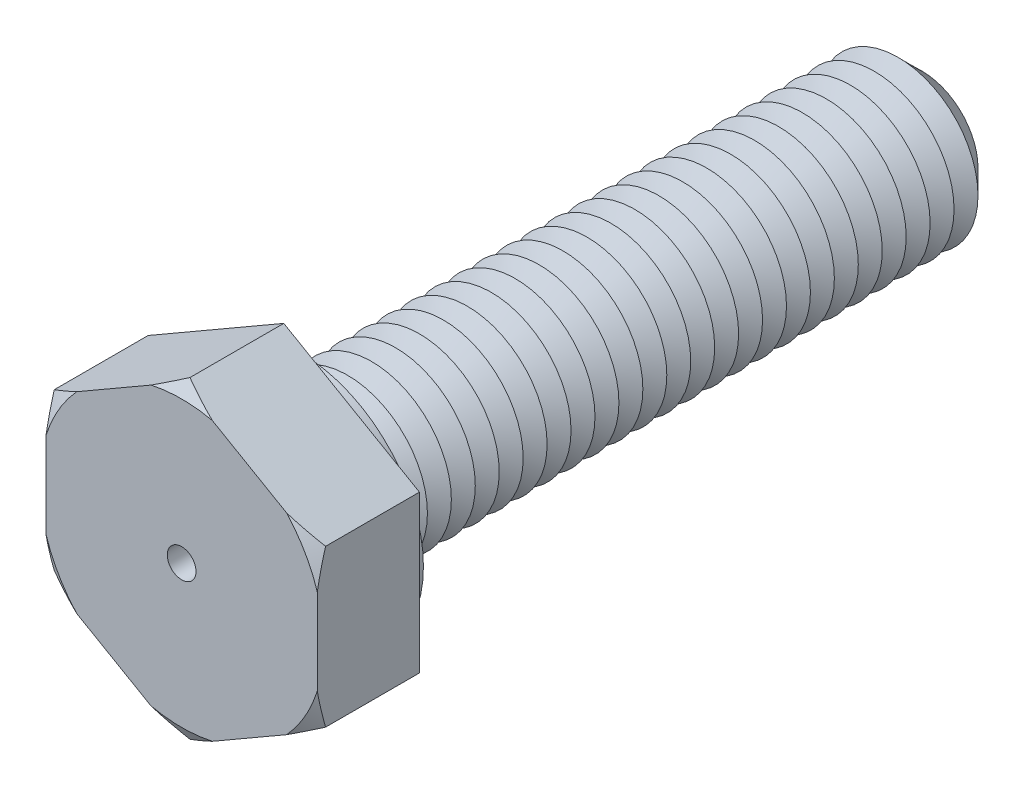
ISO-10303-21;
HEADER;
FILE_DESCRIPTION(('STEP AP214'),'2;1');
FILE_NAME('part.step','',(''),(''),'','','');
FILE_SCHEMA(('AUTOMOTIVE_DESIGN { 1 0 10303 214 1 1 1 1 }'));
ENDSEC;
DATA;
#1=APPLICATION_CONTEXT('core data for automotive mechanical design processes');
#2=APPLICATION_PROTOCOL_DEFINITION('international standard','automotive_design',2000,#1);
#3=PRODUCT_CONTEXT('',#1,'mechanical');
#4=PRODUCT('Part','Part','',(#3));
#5=PRODUCT_RELATED_PRODUCT_CATEGORY('part','',(#4));
#6=PRODUCT_DEFINITION_FORMATION('','',#4);
#7=PRODUCT_DEFINITION_CONTEXT('part definition',#1,'design');
#8=PRODUCT_DEFINITION('design','',#6,#7);
#9=PRODUCT_DEFINITION_SHAPE('','',#8);
#10=(LENGTH_UNIT() NAMED_UNIT(*) SI_UNIT(.MILLI.,.METRE.));
#11=(NAMED_UNIT(*) PLANE_ANGLE_UNIT() SI_UNIT($,.RADIAN.));
#12=(NAMED_UNIT(*) SI_UNIT($,.STERADIAN.) SOLID_ANGLE_UNIT());
#13=UNCERTAINTY_MEASURE_WITH_UNIT(LENGTH_MEASURE(1.E-05),#10,'distance_accuracy_value','');
#14=(GEOMETRIC_REPRESENTATION_CONTEXT(3) GLOBAL_UNCERTAINTY_ASSIGNED_CONTEXT((#13)) GLOBAL_UNIT_ASSIGNED_CONTEXT((#10,
#11,#12)) REPRESENTATION_CONTEXT('',''));
#15=CARTESIAN_POINT('',(0.,0.,0.));
#16=DIRECTION('',(0.,0.,1.));
#17=DIRECTION('',(1.,0.,0.));
#18=AXIS2_PLACEMENT_3D('',#15,#16,#17);
#19=CARTESIAN_POINT('',(8.5,4.90747728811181,6.4));
#20=DIRECTION('',(-0.5,-0.866025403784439,0.));
#21=DIRECTION('',(0.866025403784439,-0.5,0.));
#22=AXIS2_PLACEMENT_3D('',#19,#20,#21);
#23=PLANE('',#22);
#24=CARTESIAN_POINT('',(14.3974196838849,1.50260044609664,3.18954977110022));
#25=CARTESIAN_POINT('',(14.1303849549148,1.65677301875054,3.33361874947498));
#26=CARTESIAN_POINT('',(13.8627107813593,1.81131477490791,3.47613168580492));
#27=CARTESIAN_POINT('',(13.3258139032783,2.12129233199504,3.75731467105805));
#28=CARTESIAN_POINT('',(13.0565910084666,2.27672824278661,3.89598423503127));
#29=CARTESIAN_POINT('',(12.5155257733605,2.58911240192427,4.16915145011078));
#30=CARTESIAN_POINT('',(12.2436777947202,2.74606390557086,4.30363425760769));
#31=CARTESIAN_POINT('',(11.697943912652,3.06114350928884,4.56695627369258));
#32=CARTESIAN_POINT('',(11.4240580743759,3.21927157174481,4.69579566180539));
#33=CARTESIAN_POINT('',(10.8669438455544,3.54092162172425,4.94977636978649));
#34=CARTESIAN_POINT('',(10.5836547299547,3.70447866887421,5.07474091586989));
#35=CARTESIAN_POINT('',(10.0142178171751,4.03324322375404,5.31575754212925));
#36=CARTESIAN_POINT('',(9.72806988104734,4.19845081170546,5.43180918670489));
#37=CARTESIAN_POINT('',(9.15284957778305,4.53055440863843,5.6527883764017));
#38=CARTESIAN_POINT('',(8.86378033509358,4.69744861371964,5.75772666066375));
#39=CARTESIAN_POINT('',(8.28224800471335,5.03319646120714,5.95405449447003));
#40=CARTESIAN_POINT('',(7.98978536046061,5.20204984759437,6.04544579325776));
#41=CARTESIAN_POINT('',(7.29029341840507,5.60590170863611,6.24311258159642));
#42=CARTESIAN_POINT('',(6.88163396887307,5.84184135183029,6.34201308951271));
#43=CARTESIAN_POINT('',(6.2644717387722,6.1981601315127,6.46082851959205));
#44=CARTESIAN_POINT('',(6.05806549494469,6.31732883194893,6.49551015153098));
#45=CARTESIAN_POINT('',(5.64409758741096,6.55633331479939,6.55416143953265));
#46=CARTESIAN_POINT('',(5.43653593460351,6.67616909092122,6.57813119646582));
#47=CARTESIAN_POINT('',(5.02306823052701,6.914884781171,6.6144556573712));
#48=CARTESIAN_POINT('',(4.81717088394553,7.03375966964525,6.62694180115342));
#49=CARTESIAN_POINT('',(4.40509314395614,7.27167286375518,6.64040244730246));
#50=CARTESIAN_POINT('',(4.19891275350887,7.39071116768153,6.64137706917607));
#51=CARTESIAN_POINT('',(3.78675559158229,7.62867021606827,6.63178359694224));
#52=CARTESIAN_POINT('',(3.58077881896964,7.747590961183,6.62121556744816));
#53=CARTESIAN_POINT('',(3.16946579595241,7.9850626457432,6.58885652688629));
#54=CARTESIAN_POINT('',(2.96412965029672,8.10361352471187,6.56706376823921));
#55=CARTESIAN_POINT('',(2.47890311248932,8.38375919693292,6.50285520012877));
#56=CARTESIAN_POINT('',(2.19947000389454,8.54508997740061,6.45579627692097));
#57=CARTESIAN_POINT('',(1.6432817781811,8.86620539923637,6.34397240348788));
#58=CARTESIAN_POINT('',(1.36652705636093,9.02598981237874,6.27920487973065));
#59=CARTESIAN_POINT('',(0.815728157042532,9.34399370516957,6.13440902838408));
#60=CARTESIAN_POINT('',(0.541687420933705,9.50221119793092,6.05436342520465));
#61=CARTESIAN_POINT('',(-0.00331670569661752,9.81686947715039,5.88153285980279));
#62=CARTESIAN_POINT('',(-0.274280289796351,9.97331037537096,5.788748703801));
#63=CARTESIAN_POINT('',(-0.816522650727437,10.2863741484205,5.59147835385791));
#64=CARTESIAN_POINT('',(-1.08776675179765,10.4429770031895,5.48686595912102));
#65=CARTESIAN_POINT('',(-1.62738149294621,10.7545237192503,5.26886764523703));
#66=CARTESIAN_POINT('',(-1.89575390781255,10.9094686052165,5.15548754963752));
#67=CARTESIAN_POINT('',(-2.43005320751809,11.2179464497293,4.92150983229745));
#68=CARTESIAN_POINT('',(-2.69598059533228,11.3714796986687,4.80091373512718));
#69=CARTESIAN_POINT('',(-3.22575115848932,11.6773428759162,4.55376737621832));
#70=CARTESIAN_POINT('',(-3.48959429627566,11.829672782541,4.42721700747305));
#71=CARTESIAN_POINT('',(-3.9337259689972,12.0860923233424,4.20929972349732));
#72=CARTESIAN_POINT('',(-4.11449197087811,12.1904576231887,4.11922480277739));
#73=CARTESIAN_POINT('',(-4.47523725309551,12.3987340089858,3.93701701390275));
#74=CARTESIAN_POINT('',(-4.6552165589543,12.5026451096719,3.84488421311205));
#75=CARTESIAN_POINT('',(-5.01258669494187,12.7089728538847,3.65977671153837));
#76=CARTESIAN_POINT('',(-5.18998489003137,12.8113937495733,3.56682094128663));
#77=CARTESIAN_POINT('',(-5.54415606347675,13.0158745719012,3.3793246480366));
#78=CARTESIAN_POINT('',(-5.72092903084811,13.1179344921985,3.28478409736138));
#79=CARTESIAN_POINT('',(-5.89741968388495,13.2198314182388,3.18954977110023));
#80=B_SPLINE_CURVE_WITH_KNOTS('',3,(#24,#25,#26,#27,#28,#29,#30,#31,#32,#33,#34,#35,#36,#37,#38,
#39,#40,#41,#42,#43,#44,#45,#46,#47,#48,#49,#50,#51,#52,#53,#54,#55,#56,#57,#58,#59,#60,#61,#62,
#63,#64,#65,#66,#67,#68,#69,#70,#71,#72,#73,#74,#75,#76,#77,#78,#79),.UNSPECIFIED.,.F.,.F.,(4,2,
2,2,2,2,2,2,2,2,2,2,2,2,2,2,2,2,2,2,2,2,2,2,2,2,2,4),(0.,1.02103660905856,2.04220146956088,
3.06664888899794,4.09106369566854,5.1414707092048,6.19192902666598,7.24136281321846,
8.29066097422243,9.73548564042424,10.45782862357,11.1801648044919,11.8941264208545,
12.6080806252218,13.3220308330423,14.036092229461,15.0137259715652,15.9915018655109,
16.9703899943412,17.9492161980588,18.939699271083,19.9295300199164,20.9191523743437,
21.9087925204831,22.5907917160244,23.272768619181,23.947601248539,24.622445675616),.UNSPECIFIED.);
#81=CARTESIAN_POINT('',(8.5,4.90747728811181,5.88038475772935));
#82=VERTEX_POINT('',#81);
#83=CARTESIAN_POINT('',(6.57804882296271,6.01711631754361,6.4));
#84=VERTEX_POINT('',#83);
#85=EDGE_CURVE('E132',#82,#84,#80,.T.);
#86=ORIENTED_EDGE('',*,*,#85,.F.);
#87=DIRECTION('',(0.,0.,-1.));
#88=VECTOR('',#87,1.);
#89=CARTESIAN_POINT('',(8.5,4.90747728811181,6.4));
#90=LINE('',#89,#88);
#91=CARTESIAN_POINT('',(8.5,4.90747728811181,0.));
#92=VERTEX_POINT('',#91);
#93=EDGE_CURVE('E144',#82,#92,#90,.T.);
#94=ORIENTED_EDGE('',*,*,#93,.T.);
#95=DIRECTION('',(-0.866025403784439,0.5,0.));
#96=VECTOR('',#95,1.);
#97=CARTESIAN_POINT('',(8.5,4.90747728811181,0.));
#98=LINE('',#97,#96);
#99=CARTESIAN_POINT('',(0.,9.81495457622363,0.));
#100=VERTEX_POINT('',#99);
#101=EDGE_CURVE('E238',#92,#100,#98,.T.);
#102=ORIENTED_EDGE('',*,*,#101,.T.);
#103=DIRECTION('',(0.,0.,-1.));
#104=VECTOR('',#103,1.);
#105=CARTESIAN_POINT('',(0.,9.81495457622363,6.4));
#106=LINE('',#105,#104);
#107=CARTESIAN_POINT('',(0.,9.81495457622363,5.88038475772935));
#108=VERTEX_POINT('',#107);
#109=EDGE_CURVE('E179',#108,#100,#106,.T.);
#110=ORIENTED_EDGE('',*,*,#109,.F.);
#111=CARTESIAN_POINT('',(1.92195117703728,8.70531554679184,6.4));
#112=VERTEX_POINT('',#111);
#113=EDGE_CURVE('E151',#112,#108,#80,.T.);
#114=ORIENTED_EDGE('',*,*,#113,.F.);
#115=DIRECTION('',(-0.866025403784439,0.5,0.));
#116=VECTOR('',#115,1.);
#117=CARTESIAN_POINT('',(8.5,4.90747728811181,6.4));
#118=LINE('',#117,#116);
#119=EDGE_CURVE('E148',#84,#112,#118,.T.);
#120=ORIENTED_EDGE('',*,*,#119,.F.);
#121=EDGE_LOOP('',(#86,#94,#102,#110,#114,#120));
#122=FACE_BOUND('',#121,.T.);
#123=ADVANCED_FACE('F39',(#122),#23,.F.);
#124=CARTESIAN_POINT('',(0.,9.81495457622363,6.4));
#125=DIRECTION('',(0.5,-0.866025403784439,0.));
#126=DIRECTION('',(0.866025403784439,0.5,0.));
#127=AXIS2_PLACEMENT_3D('',#124,#125,#126);
#128=PLANE('',#127);
#129=CARTESIAN_POINT('',(5.89741968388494,13.2198314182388,3.18954977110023));
#130=CARTESIAN_POINT('',(5.63038495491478,13.0656588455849,3.33361874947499));
#131=CARTESIAN_POINT('',(5.36271078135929,12.9111170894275,3.47613168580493));
#132=CARTESIAN_POINT('',(4.82581390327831,12.6011395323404,3.75731467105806));
#133=CARTESIAN_POINT('',(4.55659100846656,12.4457036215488,3.89598423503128));
#134=CARTESIAN_POINT('',(4.01552577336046,12.1333194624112,4.16915145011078));
#135=CARTESIAN_POINT('',(3.74367779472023,11.9763679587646,4.30363425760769));
#136=CARTESIAN_POINT('',(3.19794391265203,11.6612883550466,4.56695627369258));
#137=CARTESIAN_POINT('',(2.92405807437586,11.5031602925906,4.69579566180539));
#138=CARTESIAN_POINT('',(2.3669438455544,11.1815102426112,4.9497763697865));
#139=CARTESIAN_POINT('',(2.08365472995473,11.0179531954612,5.0747409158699));
#140=CARTESIAN_POINT('',(1.51421781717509,10.6891886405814,5.31575754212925));
#141=CARTESIAN_POINT('',(1.22806988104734,10.52398105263,5.4318091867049));
#142=CARTESIAN_POINT('',(0.652849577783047,10.191877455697,5.6527883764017));
#143=CARTESIAN_POINT('',(0.363780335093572,10.0249832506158,5.75772666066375));
#144=CARTESIAN_POINT('',(-0.21775199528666,9.6892354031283,5.95405449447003));
#145=CARTESIAN_POINT('',(-0.510214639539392,9.52038201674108,6.04544579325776));
#146=CARTESIAN_POINT('',(-1.20970658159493,9.11653015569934,6.24311258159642));
#147=CARTESIAN_POINT('',(-1.61836603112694,8.88059051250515,6.34201308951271));
#148=CARTESIAN_POINT('',(-2.2355282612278,8.52427173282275,6.46082851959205));
#149=CARTESIAN_POINT('',(-2.44193450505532,8.40510303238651,6.49551015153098));
#150=CARTESIAN_POINT('',(-2.85590241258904,8.16609854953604,6.55416143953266));
#151=CARTESIAN_POINT('',(-3.0634640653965,8.04626277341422,6.57813119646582));
#152=CARTESIAN_POINT('',(-3.47693176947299,7.80754708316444,6.6144556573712));
#153=CARTESIAN_POINT('',(-3.68282911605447,7.68867219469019,6.62694180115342));
#154=CARTESIAN_POINT('',(-4.09490685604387,7.45075900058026,6.64040244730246));
#155=CARTESIAN_POINT('',(-4.30108724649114,7.33172069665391,6.64137706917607));
#156=CARTESIAN_POINT('',(-4.71324440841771,7.09376164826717,6.63178359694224));
#157=CARTESIAN_POINT('',(-4.91922118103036,6.97484090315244,6.62121556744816));
#158=CARTESIAN_POINT('',(-5.3305342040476,6.73736921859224,6.58885652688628));
#159=CARTESIAN_POINT('',(-5.53587034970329,6.61881833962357,6.5670637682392));
#160=CARTESIAN_POINT('',(-6.02109688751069,6.33867266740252,6.50285520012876));
#161=CARTESIAN_POINT('',(-6.30052999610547,6.17734188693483,6.45579627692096));
#162=CARTESIAN_POINT('',(-6.85671822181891,5.85622646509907,6.34397240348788));
#163=CARTESIAN_POINT('',(-7.13347294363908,5.6964420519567,6.27920487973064));
#164=CARTESIAN_POINT('',(-7.68427184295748,5.37843815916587,6.13440902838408));
#165=CARTESIAN_POINT('',(-7.9583125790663,5.22022066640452,6.05436342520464));
#166=CARTESIAN_POINT('',(-8.50331670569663,4.90556238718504,5.88153285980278));
#167=CARTESIAN_POINT('',(-8.77428028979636,4.74912148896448,5.78874870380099));
#168=CARTESIAN_POINT('',(-9.31652265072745,4.4360577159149,5.59147835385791));
#169=CARTESIAN_POINT('',(-9.58776675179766,4.27945486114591,5.48686595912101));
#170=CARTESIAN_POINT('',(-10.1273814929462,3.9679081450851,5.26886764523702));
#171=CARTESIAN_POINT('',(-10.3957539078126,3.81296325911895,5.15548754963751));
#172=CARTESIAN_POINT('',(-10.9300532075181,3.50448541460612,4.92150983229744));
#173=CARTESIAN_POINT('',(-11.1959805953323,3.35095216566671,4.80091373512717));
#174=CARTESIAN_POINT('',(-11.7257511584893,3.04508898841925,4.55376737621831));
#175=CARTESIAN_POINT('',(-11.9895942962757,2.89275908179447,4.42721700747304));
#176=CARTESIAN_POINT('',(-12.4337259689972,2.63633954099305,4.20929972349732));
#177=CARTESIAN_POINT('',(-12.6144919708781,2.53197424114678,4.11922480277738));
#178=CARTESIAN_POINT('',(-12.9752372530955,2.32369785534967,3.93701701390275));
#179=CARTESIAN_POINT('',(-13.1552165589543,2.21978675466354,3.84488421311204));
#180=CARTESIAN_POINT('',(-13.5125866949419,2.01345901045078,3.65977671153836));
#181=CARTESIAN_POINT('',(-13.6899848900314,1.91103811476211,3.56682094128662));
#182=CARTESIAN_POINT('',(-14.0441560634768,1.70655729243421,3.37932464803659));
#183=CARTESIAN_POINT('',(-14.2209290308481,1.60449737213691,3.28478409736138));
#184=CARTESIAN_POINT('',(-14.3974196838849,1.50260044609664,3.18954977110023));
#185=B_SPLINE_CURVE_WITH_KNOTS('',3,(#129,#130,#131,#132,#133,#134,#135,#136,#137,#138,#139,
#140,#141,#142,#143,#144,#145,#146,#147,#148,#149,#150,#151,#152,#153,#154,#155,#156,#157,#158,
#159,#160,#161,#162,#163,#164,#165,#166,#167,#168,#169,#170,#171,#172,#173,#174,#175,#176,#177,
#178,#179,#180,#181,#182,#183,#184),.UNSPECIFIED.,.F.,.F.,(4,2,2,2,2,2,2,2,2,2,2,2,2,2,2,2,2,2,
2,2,2,2,2,2,2,2,2,4),(0.,1.02103660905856,2.04220146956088,3.06664888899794,4.09106369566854,
5.14147070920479,6.19192902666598,7.24136281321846,8.29066097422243,9.73548564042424,
10.45782862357,11.1801648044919,11.8941264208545,12.6080806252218,13.3220308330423,
14.036092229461,15.0137259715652,15.991501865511,16.9703899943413,17.9492161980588,
18.939699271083,19.9295300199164,20.9191523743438,21.9087925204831,22.5907917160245,
23.272768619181,23.947601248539,24.622445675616),.UNSPECIFIED.);
#186=CARTESIAN_POINT('',(-1.92195117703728,8.70531554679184,6.4));
#187=VERTEX_POINT('',#186);
#188=EDGE_CURVE('E472',#108,#187,#185,.T.);
#189=ORIENTED_EDGE('',*,*,#188,.F.);
#190=ORIENTED_EDGE('',*,*,#109,.T.);
#191=DIRECTION('',(-0.866025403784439,-0.5,0.));
#192=VECTOR('',#191,1.);
#193=CARTESIAN_POINT('',(0.,9.81495457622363,0.));
#194=LINE('',#193,#192);
#195=CARTESIAN_POINT('',(-8.5,4.90747728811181,0.));
#196=VERTEX_POINT('',#195);
#197=EDGE_CURVE('E240',#100,#196,#194,.T.);
#198=ORIENTED_EDGE('',*,*,#197,.T.);
#199=DIRECTION('',(0.,0.,-1.));
#200=VECTOR('',#199,1.);
#201=CARTESIAN_POINT('',(-8.5,4.90747728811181,6.4));
#202=LINE('',#201,#200);
#203=CARTESIAN_POINT('',(-8.5,4.90747728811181,5.88038475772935));
#204=VERTEX_POINT('',#203);
#205=EDGE_CURVE('E176',#204,#196,#202,.T.);
#206=ORIENTED_EDGE('',*,*,#205,.F.);
#207=CARTESIAN_POINT('',(-6.57804882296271,6.01711631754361,6.4));
#208=VERTEX_POINT('',#207);
#209=EDGE_CURVE('E465',#208,#204,#185,.T.);
#210=ORIENTED_EDGE('',*,*,#209,.F.);
#211=DIRECTION('',(-0.866025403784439,-0.5,0.));
#212=VECTOR('',#211,1.);
#213=CARTESIAN_POINT('',(0.,9.81495457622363,6.4));
#214=LINE('',#213,#212);
#215=EDGE_CURVE('E215',#187,#208,#214,.T.);
#216=ORIENTED_EDGE('',*,*,#215,.F.);
#217=EDGE_LOOP('',(#189,#190,#198,#206,#210,#216));
#218=FACE_BOUND('',#217,.T.);
#219=ADVANCED_FACE('F478',(#218),#128,.F.);
#220=CARTESIAN_POINT('',(-8.5,4.90747728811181,6.4));
#221=DIRECTION('',(1.,0.,0.));
#222=DIRECTION('',(0.,0.,-1.));
#223=AXIS2_PLACEMENT_3D('',#220,#221,#222);
#224=PLANE('',#223);
#225=CARTESIAN_POINT('',(-8.5,10.8048969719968,3.60988571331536));
#226=CARTESIAN_POINT('',(-8.5,10.4978348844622,3.74918346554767));
#227=CARTESIAN_POINT('',(-8.5,10.189932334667,3.88666386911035));
#228=CARTESIAN_POINT('',(-8.5,9.57208629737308,4.15710808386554));
#229=CARTESIAN_POINT('',(-8.5,9.26214245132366,4.29007107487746));
#230=CARTESIAN_POINT('',(-8.5,8.6386633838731,4.55109231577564));
#231=CARTESIAN_POINT('',(-8.5,8.32511856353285,4.67912772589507));
#232=CARTESIAN_POINT('',(-8.5,7.69537699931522,4.92848462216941));
#233=CARTESIAN_POINT('',(-8.5,7.37918037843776,5.04980641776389));
#234=CARTESIAN_POINT('',(-8.5,6.74517674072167,5.28371307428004));
#235=CARTESIAN_POINT('',(-8.5,6.42738342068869,5.39633487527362));
#236=CARTESIAN_POINT('',(-8.5,5.78839893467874,5.61161420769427));
#237=CARTESIAN_POINT('',(-8.5,5.46720760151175,5.7142712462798));
#238=CARTESIAN_POINT('',(-8.5,4.82159629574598,5.90726308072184));
#239=CARTESIAN_POINT('',(-8.5,4.49718135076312,5.99761456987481));
#240=CARTESIAN_POINT('',(-8.5,3.84456693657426,6.16359045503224));
#241=CARTESIAN_POINT('',(-8.5,3.51636763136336,6.23921548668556));
#242=CARTESIAN_POINT('',(-8.5,2.94974096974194,6.35404738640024));
#243=CARTESIAN_POINT('',(-8.5,2.7121746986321,6.39750509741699));
#244=CARTESIAN_POINT('',(-8.5,2.23545236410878,6.47441576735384));
#245=CARTESIAN_POINT('',(-8.5,1.99629657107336,6.50787038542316));
#246=CARTESIAN_POINT('',(-8.5,1.51674855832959,6.56389930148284));
#247=CARTESIAN_POINT('',(-8.5,1.27635657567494,6.58647561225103));
#248=CARTESIAN_POINT('',(-8.5,0.794760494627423,6.62010098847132));
#249=CARTESIAN_POINT('',(-8.5,0.553556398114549,6.63115008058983));
#250=CARTESIAN_POINT('',(-8.5,0.0710159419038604,6.64137634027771));
#251=CARTESIAN_POINT('',(-8.5,-0.170320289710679,6.64055949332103));
#252=CARTESIAN_POINT('',(-8.5,-0.65265778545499,6.62709447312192));
#253=CARTESIAN_POINT('',(-8.5,-0.893659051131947,6.6144463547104));
#254=CARTESIAN_POINT('',(-8.5,-1.37480632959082,6.57770491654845));
#255=CARTESIAN_POINT('',(-8.5,-1.61495224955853,6.55361039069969));
#256=CARTESIAN_POINT('',(-8.5,-2.09391419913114,6.49466927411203));
#257=CARTESIAN_POINT('',(-8.5,-2.33273017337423,6.4598222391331));
#258=CARTESIAN_POINT('',(-8.5,-2.92716537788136,6.36046793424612));
#259=CARTESIAN_POINT('',(-8.5,-3.28176466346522,6.28983043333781));
#260=CARTESIAN_POINT('',(-8.5,-3.98672843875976,6.12983266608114));
#261=CARTESIAN_POINT('',(-8.5,-4.3370917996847,6.0404675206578));
#262=CARTESIAN_POINT('',(-8.5,-5.0342542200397,5.84616571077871));
#263=CARTESIAN_POINT('',(-8.5,-5.3810438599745,5.74119557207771));
#264=CARTESIAN_POINT('',(-8.5,-6.07054103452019,5.51879279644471));
#265=CARTESIAN_POINT('',(-8.5,-6.41324885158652,5.40136102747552));
#266=CARTESIAN_POINT('',(-8.5,-7.09891821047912,5.15508322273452));
#267=CARTESIAN_POINT('',(-8.5,-7.44183833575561,5.02612259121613));
#268=CARTESIAN_POINT('',(-8.5,-8.12447486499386,4.75996128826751));
#269=CARTESIAN_POINT('',(-8.5,-8.46419106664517,4.62276010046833));
#270=CARTESIAN_POINT('',(-8.5,-9.13876623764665,4.34260011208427));
#271=CARTESIAN_POINT('',(-8.5,-9.47364225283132,4.19968216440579));
#272=CARTESIAN_POINT('',(-8.5,-10.1409696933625,3.90850505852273));
#273=CARTESIAN_POINT('',(-8.5,-10.4734216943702,3.76024722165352));
#274=CARTESIAN_POINT('',(-8.5,-10.8048969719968,3.60988571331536));
#275=B_SPLINE_CURVE_WITH_KNOTS('',3,(#225,#226,#227,#228,#229,#230,#231,#232,#233,#234,#235,
#236,#237,#238,#239,#240,#241,#242,#243,#244,#245,#246,#247,#248,#249,#250,#251,#252,#253,#254,
#255,#256,#257,#258,#259,#260,#261,#262,#263,#264,#265,#266,#267,#268,#269,#270,#271,#272,#273,
#274),.UNSPECIFIED.,.F.,.F.,(4,2,2,2,2,2,2,2,2,2,2,2,2,2,2,2,2,2,2,2,2,2,2,2,4),(0.,
1.01155870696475,2.02330010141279,3.03927305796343,4.05519914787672,5.06654285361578,
6.07793655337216,7.08794426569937,8.09790837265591,8.82224854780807,9.5464685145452,
10.2705544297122,10.9946386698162,11.7183576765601,12.4420733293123,13.1658652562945,
13.8896870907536,14.9737367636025,16.0580692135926,17.1447621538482,18.2313794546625,
19.3303511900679,20.4293918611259,21.5216359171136,22.6136115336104),.UNSPECIFIED.);
#276=CARTESIAN_POINT('',(-8.5,2.68819922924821,6.4));
#277=VERTEX_POINT('',#276);
#278=EDGE_CURVE('E222',#204,#277,#275,.T.);
#279=ORIENTED_EDGE('',*,*,#278,.F.);
#280=ORIENTED_EDGE('',*,*,#205,.T.);
#281=DIRECTION('',(0.,-1.,0.));
#282=VECTOR('',#281,1.);
#283=CARTESIAN_POINT('',(-8.5,4.90747728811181,0.));
#284=LINE('',#283,#282);
#285=CARTESIAN_POINT('',(-8.5,-4.90747728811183,0.));
#286=VERTEX_POINT('',#285);
#287=EDGE_CURVE('E245',#196,#286,#284,.T.);
#288=ORIENTED_EDGE('',*,*,#287,.T.);
#289=DIRECTION('',(0.,0.,-1.));
#290=VECTOR('',#289,1.);
#291=CARTESIAN_POINT('',(-8.5,-4.90747728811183,6.4));
#292=LINE('',#291,#290);
#293=CARTESIAN_POINT('',(-8.49999999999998,-4.90747728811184,5.88038475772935));
#294=VERTEX_POINT('',#293);
#295=EDGE_CURVE('E173',#294,#286,#292,.T.);
#296=ORIENTED_EDGE('',*,*,#295,.F.);
#297=CARTESIAN_POINT('',(-8.5,-2.68819922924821,6.4));
#298=VERTEX_POINT('',#297);
#299=EDGE_CURVE('E225',#298,#294,#275,.T.);
#300=ORIENTED_EDGE('',*,*,#299,.F.);
#301=DIRECTION('',(0.,-1.,0.));
#302=VECTOR('',#301,1.);
#303=CARTESIAN_POINT('',(-8.5,4.90747728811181,6.4));
#304=LINE('',#303,#302);
#305=EDGE_CURVE('E213',#277,#298,#304,.T.);
#306=ORIENTED_EDGE('',*,*,#305,.F.);
#307=EDGE_LOOP('',(#279,#280,#288,#296,#300,#306));
#308=FACE_BOUND('',#307,.T.);
#309=ADVANCED_FACE('F221',(#308),#224,.F.);
#310=CARTESIAN_POINT('',(-8.5,-4.90747728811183,6.4));
#311=DIRECTION('',(0.5,0.866025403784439,0.));
#312=DIRECTION('',(-0.866025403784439,0.5,0.));
#313=AXIS2_PLACEMENT_3D('',#310,#311,#312);
#314=PLANE('',#313);
#315=CARTESIAN_POINT('',(-14.3974196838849,-1.50260044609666,3.18954977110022));
#316=CARTESIAN_POINT('',(-14.1303849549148,-1.65677301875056,3.33361874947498));
#317=CARTESIAN_POINT('',(-13.8627107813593,-1.81131477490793,3.47613168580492));
#318=CARTESIAN_POINT('',(-13.3258139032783,-2.12129233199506,3.75731467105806));
#319=CARTESIAN_POINT('',(-13.0565910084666,-2.27672824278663,3.89598423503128));
#320=CARTESIAN_POINT('',(-12.5155257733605,-2.58911240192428,4.16915145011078));
#321=CARTESIAN_POINT('',(-12.2436777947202,-2.74606390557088,4.30363425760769));
#322=CARTESIAN_POINT('',(-11.697943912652,-3.06114350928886,4.56695627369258));
#323=CARTESIAN_POINT('',(-11.4240580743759,-3.21927157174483,4.69579566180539));
#324=CARTESIAN_POINT('',(-10.8669438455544,-3.54092162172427,4.94977636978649));
#325=CARTESIAN_POINT('',(-10.5836547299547,-3.70447866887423,5.07474091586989));
#326=CARTESIAN_POINT('',(-10.0142178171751,-4.03324322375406,5.31575754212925));
#327=CARTESIAN_POINT('',(-9.72806988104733,-4.19845081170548,5.43180918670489));
#328=CARTESIAN_POINT('',(-9.15284957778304,-4.53055440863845,5.65278837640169));
#329=CARTESIAN_POINT('',(-8.86378033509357,-4.69744861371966,5.75772666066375));
#330=CARTESIAN_POINT('',(-8.28224800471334,-5.03319646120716,5.95405449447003));
#331=CARTESIAN_POINT('',(-7.9897853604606,-5.20204984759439,6.04544579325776));
#332=CARTESIAN_POINT('',(-7.29029341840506,-5.60590170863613,6.24311258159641));
#333=CARTESIAN_POINT('',(-6.88163396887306,-5.84184135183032,6.34201308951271));
#334=CARTESIAN_POINT('',(-6.26447173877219,-6.19816013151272,6.46082851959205));
#335=CARTESIAN_POINT('',(-6.05806549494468,-6.31732883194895,6.49551015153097));
#336=CARTESIAN_POINT('',(-5.64409758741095,-6.55633331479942,6.55416143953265));
#337=CARTESIAN_POINT('',(-5.4365359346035,-6.67616909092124,6.57813119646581));
#338=CARTESIAN_POINT('',(-5.023068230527,-6.91488478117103,6.6144556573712));
#339=CARTESIAN_POINT('',(-4.81717088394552,-7.03375966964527,6.62694180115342));
#340=CARTESIAN_POINT('',(-4.40509314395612,-7.2716728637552,6.64040244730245));
#341=CARTESIAN_POINT('',(-4.19891275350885,-7.39071116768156,6.64137706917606));
#342=CARTESIAN_POINT('',(-3.78675559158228,-7.6286702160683,6.63178359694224));
#343=CARTESIAN_POINT('',(-3.58077881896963,-7.74759096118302,6.62121556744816));
#344=CARTESIAN_POINT('',(-3.16946579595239,-7.98506264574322,6.58885652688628));
#345=CARTESIAN_POINT('',(-2.9641296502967,-8.10361352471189,6.5670637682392));
#346=CARTESIAN_POINT('',(-2.4789031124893,-8.38375919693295,6.50285520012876));
#347=CARTESIAN_POINT('',(-2.19947000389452,-8.54508997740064,6.45579627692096));
#348=CARTESIAN_POINT('',(-1.64328177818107,-8.8662053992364,6.34397240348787));
#349=CARTESIAN_POINT('',(-1.36652705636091,-9.02598981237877,6.27920487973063));
#350=CARTESIAN_POINT('',(-0.815728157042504,-9.3439937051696,6.13440902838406));
#351=CARTESIAN_POINT('',(-0.541687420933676,-9.50221119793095,6.05436342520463));
#352=CARTESIAN_POINT('',(0.00331670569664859,-9.81686947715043,5.88153285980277));
#353=CARTESIAN_POINT('',(0.274280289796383,-9.973310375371,5.78874870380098));
#354=CARTESIAN_POINT('',(0.81652265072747,-10.2863741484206,5.59147835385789));
#355=CARTESIAN_POINT('',(1.08776675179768,-10.4429770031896,5.486865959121));
#356=CARTESIAN_POINT('',(1.62738149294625,-10.7545237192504,5.268867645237));
#357=CARTESIAN_POINT('',(1.89575390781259,-10.9094686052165,5.15548754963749));
#358=CARTESIAN_POINT('',(2.43005320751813,-11.2179464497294,4.92150983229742));
#359=CARTESIAN_POINT('',(2.69598059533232,-11.3714796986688,4.80091373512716));
#360=CARTESIAN_POINT('',(3.22575115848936,-11.6773428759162,4.55376737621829));
#361=CARTESIAN_POINT('',(3.48959429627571,-11.829672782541,4.42721700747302));
#362=CARTESIAN_POINT('',(3.93372596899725,-12.0860923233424,4.20929972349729));
#363=CARTESIAN_POINT('',(4.11449197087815,-12.1904576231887,4.11922480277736));
#364=CARTESIAN_POINT('',(4.47523725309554,-12.3987340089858,3.93701701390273));
#365=CARTESIAN_POINT('',(4.65521655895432,-12.5026451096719,3.84488421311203));
#366=CARTESIAN_POINT('',(5.01258669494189,-12.7089728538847,3.65977671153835));
#367=CARTESIAN_POINT('',(5.18998489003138,-12.8113937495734,3.56682094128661));
#368=CARTESIAN_POINT('',(5.54415606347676,-13.0158745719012,3.37932464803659));
#369=CARTESIAN_POINT('',(5.72092903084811,-13.1179344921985,3.28478409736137));
#370=CARTESIAN_POINT('',(5.89741968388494,-13.2198314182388,3.18954977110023));
#371=B_SPLINE_CURVE_WITH_KNOTS('',3,(#315,#316,#317,#318,#319,#320,#321,#322,#323,#324,#325,
#326,#327,#328,#329,#330,#331,#332,#333,#334,#335,#336,#337,#338,#339,#340,#341,#342,#343,#344,
#345,#346,#347,#348,#349,#350,#351,#352,#353,#354,#355,#356,#357,#358,#359,#360,#361,#362,#363,
#364,#365,#366,#367,#368,#369,#370),.UNSPECIFIED.,.F.,.F.,(4,2,2,2,2,2,2,2,2,2,2,2,2,2,2,2,2,2,
2,2,2,2,2,2,2,2,2,4),(0.,1.02103660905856,2.04220146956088,3.06664888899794,4.09106369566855,
5.1414707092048,6.19192902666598,7.24136281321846,8.29066097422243,9.73548564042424,
10.45782862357,11.1801648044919,11.8941264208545,12.6080806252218,13.3220308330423,
14.036092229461,15.0137259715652,15.991501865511,16.9703899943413,17.9492161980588,
18.939699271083,19.9295300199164,20.9191523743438,21.9087925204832,22.5907917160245,
23.272768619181,23.947601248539,24.622445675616),.UNSPECIFIED.);
#372=CARTESIAN_POINT('',(-6.57804882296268,-6.01711631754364,6.4));
#373=VERTEX_POINT('',#372);
#374=EDGE_CURVE('E515',#294,#373,#371,.T.);
#375=ORIENTED_EDGE('',*,*,#374,.F.);
#376=ORIENTED_EDGE('',*,*,#295,.T.);
#377=DIRECTION('',(0.866025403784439,-0.5,0.));
#378=VECTOR('',#377,1.);
#379=CARTESIAN_POINT('',(-8.5,-4.90747728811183,0.));
#380=LINE('',#379,#378);
#381=CARTESIAN_POINT('',(0.,-9.81495457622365,0.));
#382=VERTEX_POINT('',#381);
#383=EDGE_CURVE('E249',#286,#382,#380,.T.);
#384=ORIENTED_EDGE('',*,*,#383,.T.);
#385=DIRECTION('',(0.,0.,-1.));
#386=VECTOR('',#385,1.);
#387=CARTESIAN_POINT('',(0.,-9.81495457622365,6.4));
#388=LINE('',#387,#386);
#389=CARTESIAN_POINT('',(0.,-9.81495457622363,5.88038475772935));
#390=VERTEX_POINT('',#389);
#391=EDGE_CURVE('E163',#390,#382,#388,.T.);
#392=ORIENTED_EDGE('',*,*,#391,.F.);
#393=CARTESIAN_POINT('',(-1.92195117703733,-8.70531554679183,6.4));
#394=VERTEX_POINT('',#393);
#395=EDGE_CURVE('E509',#394,#390,#371,.T.);
#396=ORIENTED_EDGE('',*,*,#395,.F.);
#397=DIRECTION('',(0.866025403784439,-0.5,0.));
#398=VECTOR('',#397,1.);
#399=CARTESIAN_POINT('',(-8.5,-4.90747728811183,6.4));
#400=LINE('',#399,#398);
#401=EDGE_CURVE('E227',#373,#394,#400,.T.);
#402=ORIENTED_EDGE('',*,*,#401,.F.);
#403=EDGE_LOOP('',(#375,#376,#384,#392,#396,#402));
#404=FACE_BOUND('',#403,.T.);
#405=ADVANCED_FACE('F516',(#404),#314,.F.);
#406=CARTESIAN_POINT('',(0.,-9.81495457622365,6.4));
#407=DIRECTION('',(-0.5,0.866025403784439,0.));
#408=DIRECTION('',(-0.866025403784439,-0.5,0.));
#409=AXIS2_PLACEMENT_3D('',#406,#407,#408);
#410=PLANE('',#409);
#411=CARTESIAN_POINT('',(-5.89741968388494,-13.2198314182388,3.18954977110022));
#412=CARTESIAN_POINT('',(-5.63038495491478,-13.0656588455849,3.33361874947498));
#413=CARTESIAN_POINT('',(-5.36271078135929,-12.9111170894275,3.47613168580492));
#414=CARTESIAN_POINT('',(-4.8258139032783,-12.6011395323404,3.75731467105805));
#415=CARTESIAN_POINT('',(-4.55659100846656,-12.4457036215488,3.89598423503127));
#416=CARTESIAN_POINT('',(-4.01552577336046,-12.1333194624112,4.16915145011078));
#417=CARTESIAN_POINT('',(-3.74367779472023,-11.9763679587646,4.30363425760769));
#418=CARTESIAN_POINT('',(-3.19794391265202,-11.6612883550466,4.56695627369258));
#419=CARTESIAN_POINT('',(-2.92405807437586,-11.5031602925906,4.69579566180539));
#420=CARTESIAN_POINT('',(-2.36694384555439,-11.1815102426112,4.94977636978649));
#421=CARTESIAN_POINT('',(-2.08365472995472,-11.0179531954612,5.07474091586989));
#422=CARTESIAN_POINT('',(-1.51421781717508,-10.6891886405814,5.31575754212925));
#423=CARTESIAN_POINT('',(-1.22806988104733,-10.52398105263,5.43180918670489));
#424=CARTESIAN_POINT('',(-0.652849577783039,-10.191877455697,5.65278837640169));
#425=CARTESIAN_POINT('',(-0.363780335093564,-10.0249832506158,5.75772666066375));
#426=CARTESIAN_POINT('',(0.217751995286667,-9.68923540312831,5.95405449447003));
#427=CARTESIAN_POINT('',(0.5102146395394,-9.52038201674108,6.04544579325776));
#428=CARTESIAN_POINT('',(1.20970658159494,-9.11653015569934,6.24311258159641));
#429=CARTESIAN_POINT('',(1.61836603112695,-8.88059051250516,6.34201308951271));
#430=CARTESIAN_POINT('',(2.23552826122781,-8.52427173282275,6.46082851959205));
#431=CARTESIAN_POINT('',(2.44193450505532,-8.40510303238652,6.49551015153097));
#432=CARTESIAN_POINT('',(2.85590241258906,-8.16609854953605,6.55416143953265));
#433=CARTESIAN_POINT('',(3.06346406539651,-8.04626277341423,6.57813119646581));
#434=CARTESIAN_POINT('',(3.47693176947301,-7.80754708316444,6.61445565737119));
#435=CARTESIAN_POINT('',(3.68282911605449,-7.6886721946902,6.62694180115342));
#436=CARTESIAN_POINT('',(4.09490685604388,-7.45075900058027,6.64040244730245));
#437=CARTESIAN_POINT('',(4.30108724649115,-7.33172069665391,6.64137706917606));
#438=CARTESIAN_POINT('',(4.71324440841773,-7.09376164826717,6.63178359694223));
#439=CARTESIAN_POINT('',(4.91922118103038,-6.97484090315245,6.62121556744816));
#440=CARTESIAN_POINT('',(5.33053420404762,-6.73736921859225,6.58885652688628));
#441=CARTESIAN_POINT('',(5.5358703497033,-6.61881833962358,6.5670637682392));
#442=CARTESIAN_POINT('',(6.02109688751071,-6.33867266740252,6.50285520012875));
#443=CARTESIAN_POINT('',(6.30052999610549,-6.17734188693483,6.45579627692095));
#444=CARTESIAN_POINT('',(6.85671822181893,-5.85622646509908,6.34397240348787));
#445=CARTESIAN_POINT('',(7.1334729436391,-5.6964420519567,6.27920487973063));
#446=CARTESIAN_POINT('',(7.6842718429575,-5.37843815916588,6.13440902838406));
#447=CARTESIAN_POINT('',(7.95831257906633,-5.22022066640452,6.05436342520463));
#448=CARTESIAN_POINT('',(8.50331670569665,-4.90556238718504,5.88153285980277));
#449=CARTESIAN_POINT('',(8.77428028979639,-4.74912148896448,5.78874870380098));
#450=CARTESIAN_POINT('',(9.31652265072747,-4.4360577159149,5.59147835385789));
#451=CARTESIAN_POINT('',(9.58776675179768,-4.27945486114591,5.486865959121));
#452=CARTESIAN_POINT('',(10.1273814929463,-3.9679081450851,5.268867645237));
#453=CARTESIAN_POINT('',(10.3957539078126,-3.81296325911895,5.15548754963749));
#454=CARTESIAN_POINT('',(10.9300532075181,-3.50448541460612,4.92150983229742));
#455=CARTESIAN_POINT('',(11.1959805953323,-3.35095216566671,4.80091373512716));
#456=CARTESIAN_POINT('',(11.7257511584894,-3.04508898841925,4.5537673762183));
#457=CARTESIAN_POINT('',(11.9895942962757,-2.89275908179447,4.42721700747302));
#458=CARTESIAN_POINT('',(12.4337259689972,-2.63633954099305,4.20929972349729));
#459=CARTESIAN_POINT('',(12.6144919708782,-2.53197424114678,4.11922480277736));
#460=CARTESIAN_POINT('',(12.9752372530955,-2.32369785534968,3.93701701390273));
#461=CARTESIAN_POINT('',(13.1552165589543,-2.21978675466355,3.84488421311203));
#462=CARTESIAN_POINT('',(13.5125866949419,-2.0134590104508,3.65977671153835));
#463=CARTESIAN_POINT('',(13.6899848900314,-1.91103811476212,3.56682094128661));
#464=CARTESIAN_POINT('',(14.0441560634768,-1.70655729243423,3.37932464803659));
#465=CARTESIAN_POINT('',(14.2209290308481,-1.60449737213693,3.28478409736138));
#466=CARTESIAN_POINT('',(14.3974196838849,-1.50260044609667,3.18954977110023));
#467=B_SPLINE_CURVE_WITH_KNOTS('',3,(#411,#412,#413,#414,#415,#416,#417,#418,#419,#420,#421,
#422,#423,#424,#425,#426,#427,#428,#429,#430,#431,#432,#433,#434,#435,#436,#437,#438,#439,#440,
#441,#442,#443,#444,#445,#446,#447,#448,#449,#450,#451,#452,#453,#454,#455,#456,#457,#458,#459,
#460,#461,#462,#463,#464,#465,#466),.UNSPECIFIED.,.F.,.F.,(4,2,2,2,2,2,2,2,2,2,2,2,2,2,2,2,2,2,
2,2,2,2,2,2,2,2,2,4),(0.,1.02103660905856,2.04220146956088,3.06664888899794,4.09106369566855,
5.1414707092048,6.19192902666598,7.24136281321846,8.29066097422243,9.73548564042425,
10.45782862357,11.1801648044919,11.8941264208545,12.6080806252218,13.3220308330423,
14.036092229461,15.0137259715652,15.991501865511,16.9703899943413,17.9492161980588,
18.939699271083,19.9295300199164,20.9191523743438,21.9087925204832,22.5907917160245,
23.272768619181,23.947601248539,24.622445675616),.UNSPECIFIED.);
#468=CARTESIAN_POINT('',(1.92195117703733,-8.70531554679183,6.4));
#469=VERTEX_POINT('',#468);
#470=EDGE_CURVE('E64',#390,#469,#467,.T.);
#471=ORIENTED_EDGE('',*,*,#470,.F.);
#472=ORIENTED_EDGE('',*,*,#391,.T.);
#473=DIRECTION('',(0.866025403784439,0.5,0.));
#474=VECTOR('',#473,1.);
#475=CARTESIAN_POINT('',(0.,-9.81495457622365,0.));
#476=LINE('',#475,#474);
#477=CARTESIAN_POINT('',(8.5,-4.90747728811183,0.));
#478=VERTEX_POINT('',#477);
#479=EDGE_CURVE('E252',#382,#478,#476,.T.);
#480=ORIENTED_EDGE('',*,*,#479,.T.);
#481=DIRECTION('',(0.,0.,-1.));
#482=VECTOR('',#481,1.);
#483=CARTESIAN_POINT('',(8.5,-4.90747728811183,6.4));
#484=LINE('',#483,#482);
#485=CARTESIAN_POINT('',(8.5,-4.90747728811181,5.88038475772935));
#486=VERTEX_POINT('',#485);
#487=EDGE_CURVE('E157',#486,#478,#484,.T.);
#488=ORIENTED_EDGE('',*,*,#487,.F.);
#489=CARTESIAN_POINT('',(6.57804882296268,-6.01711631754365,6.4));
#490=VERTEX_POINT('',#489);
#491=EDGE_CURVE('E504',#490,#486,#467,.T.);
#492=ORIENTED_EDGE('',*,*,#491,.F.);
#493=DIRECTION('',(0.866025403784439,0.5,0.));
#494=VECTOR('',#493,1.);
#495=CARTESIAN_POINT('',(0.,-9.81495457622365,6.4));
#496=LINE('',#495,#494);
#497=EDGE_CURVE('E166',#469,#490,#496,.T.);
#498=ORIENTED_EDGE('',*,*,#497,.F.);
#499=EDGE_LOOP('',(#471,#472,#480,#488,#492,#498));
#500=FACE_BOUND('',#499,.T.);
#501=ADVANCED_FACE('F519',(#500),#410,.F.);
#502=CARTESIAN_POINT('',(8.5,-4.90747728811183,6.4));
#503=DIRECTION('',(-1.,0.,0.));
#504=DIRECTION('',(0.,0.,1.));
#505=AXIS2_PLACEMENT_3D('',#502,#503,#504);
#506=PLANE('',#505);
#507=CARTESIAN_POINT('',(8.5,-10.8048969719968,3.60988571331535));
#508=CARTESIAN_POINT('',(8.5,-10.4978348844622,3.74918346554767));
#509=CARTESIAN_POINT('',(8.5,-10.189932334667,3.88666386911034));
#510=CARTESIAN_POINT('',(8.5,-9.5720862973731,4.15710808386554));
#511=CARTESIAN_POINT('',(8.5,-9.26214245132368,4.29007107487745));
#512=CARTESIAN_POINT('',(8.5,-8.63866338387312,4.55109231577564));
#513=CARTESIAN_POINT('',(8.5,-8.32511856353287,4.67912772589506));
#514=CARTESIAN_POINT('',(8.5,-7.69537699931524,4.9284846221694));
#515=CARTESIAN_POINT('',(8.5,-7.37918037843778,5.04980641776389));
#516=CARTESIAN_POINT('',(8.5,-6.74517674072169,5.28371307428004));
#517=CARTESIAN_POINT('',(8.5,-6.42738342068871,5.39633487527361));
#518=CARTESIAN_POINT('',(8.5,-5.78839893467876,5.61161420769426));
#519=CARTESIAN_POINT('',(8.5,-5.46720760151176,5.71427124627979));
#520=CARTESIAN_POINT('',(8.5,-4.821596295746,5.90726308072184));
#521=CARTESIAN_POINT('',(8.5,-4.49718135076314,5.99761456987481));
#522=CARTESIAN_POINT('',(8.5,-3.84456693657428,6.16359045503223));
#523=CARTESIAN_POINT('',(8.5,-3.51636763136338,6.23921548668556));
#524=CARTESIAN_POINT('',(8.5,-2.94974096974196,6.35404738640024));
#525=CARTESIAN_POINT('',(8.5,-2.71217469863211,6.39750509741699));
#526=CARTESIAN_POINT('',(8.5,-2.2354523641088,6.47441576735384));
#527=CARTESIAN_POINT('',(8.5,-1.99629657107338,6.50787038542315));
#528=CARTESIAN_POINT('',(8.5,-1.51674855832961,6.56389930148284));
#529=CARTESIAN_POINT('',(8.5,-1.27635657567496,6.58647561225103));
#530=CARTESIAN_POINT('',(8.5,-0.794760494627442,6.62010098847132));
#531=CARTESIAN_POINT('',(8.5,-0.553556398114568,6.63115008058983));
#532=CARTESIAN_POINT('',(8.5,-0.0710159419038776,6.64137634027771));
#533=CARTESIAN_POINT('',(8.5,0.170320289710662,6.64055949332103));
#534=CARTESIAN_POINT('',(8.5,0.652657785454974,6.62709447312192));
#535=CARTESIAN_POINT('',(8.5,0.89365905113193,6.61444635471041));
#536=CARTESIAN_POINT('',(8.5,1.37480632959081,6.57770491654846));
#537=CARTESIAN_POINT('',(8.5,1.61495224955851,6.55361039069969));
#538=CARTESIAN_POINT('',(8.5,2.09391419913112,6.49466927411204));
#539=CARTESIAN_POINT('',(8.5,2.33273017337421,6.45982223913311));
#540=CARTESIAN_POINT('',(8.5,2.92716537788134,6.36046793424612));
#541=CARTESIAN_POINT('',(8.5,3.2817646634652,6.28983043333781));
#542=CARTESIAN_POINT('',(8.5,3.98672843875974,6.12983266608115));
#543=CARTESIAN_POINT('',(8.5,4.33709179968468,6.04046752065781));
#544=CARTESIAN_POINT('',(8.5,5.03425422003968,5.84616571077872));
#545=CARTESIAN_POINT('',(8.5,5.38104385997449,5.74119557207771));
#546=CARTESIAN_POINT('',(8.5,6.07054103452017,5.51879279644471));
#547=CARTESIAN_POINT('',(8.5,6.4132488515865,5.40136102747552));
#548=CARTESIAN_POINT('',(8.5,7.0989182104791,5.15508322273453));
#549=CARTESIAN_POINT('',(8.5,7.4418383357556,5.02612259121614));
#550=CARTESIAN_POINT('',(8.5,8.12447486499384,4.75996128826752));
#551=CARTESIAN_POINT('',(8.5,8.46419106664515,4.62276010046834));
#552=CARTESIAN_POINT('',(8.5,9.13876623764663,4.34260011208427));
#553=CARTESIAN_POINT('',(8.5,9.47364225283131,4.19968216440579));
#554=CARTESIAN_POINT('',(8.5,10.1409696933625,3.90850505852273));
#555=CARTESIAN_POINT('',(8.5,10.4734216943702,3.76024722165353));
#556=CARTESIAN_POINT('',(8.5,10.8048969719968,3.60988571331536));
#557=B_SPLINE_CURVE_WITH_KNOTS('',3,(#507,#508,#509,#510,#511,#512,#513,#514,#515,#516,#517,
#518,#519,#520,#521,#522,#523,#524,#525,#526,#527,#528,#529,#530,#531,#532,#533,#534,#535,#536,
#537,#538,#539,#540,#541,#542,#543,#544,#545,#546,#547,#548,#549,#550,#551,#552,#553,#554,#555,
#556),.UNSPECIFIED.,.F.,.F.,(4,2,2,2,2,2,2,2,2,2,2,2,2,2,2,2,2,2,2,2,2,2,2,2,4),(0.,
1.01155870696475,2.02330010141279,3.03927305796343,4.05519914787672,5.06654285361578,
6.07793655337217,7.08794426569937,8.09790837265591,8.82224854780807,9.5464685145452,
10.2705544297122,10.9946386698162,11.7183576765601,12.4420733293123,13.1658652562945,
13.8896870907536,14.9737367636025,16.0580692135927,17.1447621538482,18.2313794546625,
19.3303511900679,20.4293918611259,21.5216359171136,22.6136115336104),.UNSPECIFIED.);
#558=CARTESIAN_POINT('',(8.5,-2.68819922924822,6.4));
#559=VERTEX_POINT('',#558);
#560=EDGE_CURVE('E56',#486,#559,#557,.T.);
#561=ORIENTED_EDGE('',*,*,#560,.F.);
#562=ORIENTED_EDGE('',*,*,#487,.T.);
#563=DIRECTION('',(0.,1.,0.));
#564=VECTOR('',#563,1.);
#565=CARTESIAN_POINT('',(8.5,-4.90747728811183,0.));
#566=LINE('',#565,#564);
#567=EDGE_CURVE('E154',#478,#92,#566,.T.);
#568=ORIENTED_EDGE('',*,*,#567,.T.);
#569=ORIENTED_EDGE('',*,*,#93,.F.);
#570=CARTESIAN_POINT('',(8.5,2.68819922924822,6.4));
#571=VERTEX_POINT('',#570);
#572=EDGE_CURVE('E129',#571,#82,#557,.T.);
#573=ORIENTED_EDGE('',*,*,#572,.F.);
#574=DIRECTION('',(0.,1.,0.));
#575=VECTOR('',#574,1.);
#576=CARTESIAN_POINT('',(8.5,-4.90747728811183,6.4));
#577=LINE('',#576,#575);
#578=EDGE_CURVE('E158',#559,#571,#577,.T.);
#579=ORIENTED_EDGE('',*,*,#578,.F.);
#580=EDGE_LOOP('',(#561,#562,#568,#569,#573,#579));
#581=FACE_BOUND('',#580,.T.);
#582=ADVANCED_FACE('F152',(#581),#506,.F.);
#583=CARTESIAN_POINT('',(0.,0.,6.4));
#584=DIRECTION('',(0.,0.,1.));
#585=DIRECTION('',(1.,0.,0.));
#586=AXIS2_PLACEMENT_3D('',#583,#584,#585);
#587=PLANE('',#586);
#588=CARTESIAN_POINT('',(0.,0.,6.4));
#589=DIRECTION('',(0.,0.,1.));
#590=DIRECTION('',(1.,0.,0.));
#591=AXIS2_PLACEMENT_3D('',#588,#589,#590);
#592=CIRCLE('',#591,0.9);
#593=CARTESIAN_POINT('',(0.9,0.,6.4));
#594=VERTEX_POINT('',#593);
#595=EDGE_CURVE('E1245',#594,#594,#592,.T.);
#596=ORIENTED_EDGE('',*,*,#595,.F.);
#597=EDGE_LOOP('',(#596));
#598=FACE_BOUND('',#597,.T.);
#599=ORIENTED_EDGE('',*,*,#578,.T.);
#600=CARTESIAN_POINT('',(0.,0.,6.4));
#601=DIRECTION('',(0.,0.,1.));
#602=DIRECTION('',(1.,0.,0.));
#603=AXIS2_PLACEMENT_3D('',#600,#601,#602);
#604=CIRCLE('',#603,8.91495457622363);
#605=EDGE_CURVE('E134',#571,#84,#604,.T.);
#606=ORIENTED_EDGE('',*,*,#605,.T.);
#607=ORIENTED_EDGE('',*,*,#119,.T.);
#608=CARTESIAN_POINT('',(0.,0.,6.4));
#609=DIRECTION('',(0.,0.,1.));
#610=DIRECTION('',(1.,0.,0.));
#611=AXIS2_PLACEMENT_3D('',#608,#609,#610);
#612=CIRCLE('',#611,8.91495457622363);
#613=EDGE_CURVE('E11',#112,#187,#612,.T.);
#614=ORIENTED_EDGE('',*,*,#613,.T.);
#615=ORIENTED_EDGE('',*,*,#215,.T.);
#616=EDGE_CURVE('E49',#208,#277,#612,.T.);
#617=ORIENTED_EDGE('',*,*,#616,.T.);
#618=ORIENTED_EDGE('',*,*,#305,.T.);
#619=EDGE_CURVE('E197',#298,#373,#612,.T.);
#620=ORIENTED_EDGE('',*,*,#619,.T.);
#621=ORIENTED_EDGE('',*,*,#401,.T.);
#622=EDGE_CURVE('E192',#394,#469,#612,.T.);
#623=ORIENTED_EDGE('',*,*,#622,.T.);
#624=ORIENTED_EDGE('',*,*,#497,.T.);
#625=EDGE_CURVE('E43',#490,#559,#612,.T.);
#626=ORIENTED_EDGE('',*,*,#625,.T.);
#627=EDGE_LOOP('',(#599,#606,#607,#614,#615,#617,#618,#620,#621,#623,#624,#626));
#628=FACE_BOUND('',#627,.T.);
#629=ADVANCED_FACE('F212',(#598,#628),#587,.T.);
#630=CARTESIAN_POINT('',(0.,0.,0.));
#631=DIRECTION('',(0.,0.,1.));
#632=DIRECTION('',(1.,0.,0.));
#633=AXIS2_PLACEMENT_3D('',#630,#631,#632);
#634=PLANE('',#633);
#635=CARTESIAN_POINT('',(0.,0.,0.));
#636=DIRECTION('',(0.,0.,1.));
#637=DIRECTION('',(1.,0.,0.));
#638=AXIS2_PLACEMENT_3D('',#635,#636,#637);
#639=CIRCLE('',#638,7.75);
#640=CARTESIAN_POINT('',(7.75,0.,0.));
#641=VERTEX_POINT('',#640);
#642=EDGE_CURVE('E181',#641,#641,#639,.F.);
#643=ORIENTED_EDGE('',*,*,#642,.F.);
#644=EDGE_LOOP('',(#643));
#645=FACE_BOUND('',#644,.T.);
#646=ORIENTED_EDGE('',*,*,#101,.F.);
#647=ORIENTED_EDGE('',*,*,#567,.F.);
#648=ORIENTED_EDGE('',*,*,#479,.F.);
#649=ORIENTED_EDGE('',*,*,#383,.F.);
#650=ORIENTED_EDGE('',*,*,#287,.F.);
#651=ORIENTED_EDGE('',*,*,#197,.F.);
#652=EDGE_LOOP('',(#646,#647,#648,#649,#650,#651));
#653=FACE_BOUND('',#652,.T.);
#654=ADVANCED_FACE('F563',(#645,#653),#634,.F.);
#655=CARTESIAN_POINT('',(0.,0.,-1.));
#656=DIRECTION('',(0.,0.,1.));
#657=DIRECTION('',(1.,0.,0.));
#658=AXIS2_PLACEMENT_3D('',#655,#656,#657);
#659=CYLINDRICAL_SURFACE('',#658,7.75);
#660=CARTESIAN_POINT('',(0.,0.,-1.));
#661=DIRECTION('',(0.,0.,-1.));
#662=DIRECTION('',(-1.,0.,0.));
#663=AXIS2_PLACEMENT_3D('',#660,#661,#662);
#664=CIRCLE('',#663,7.75);
#665=CARTESIAN_POINT('',(-7.75,0.,-1.));
#666=VERTEX_POINT('',#665);
#667=EDGE_CURVE('E241',#666,#666,#664,.T.);
#668=ORIENTED_EDGE('',*,*,#667,.F.);
#669=EDGE_LOOP('',(#668));
#670=FACE_BOUND('',#669,.T.);
#671=ORIENTED_EDGE('',*,*,#642,.T.);
#672=EDGE_LOOP('',(#671));
#673=FACE_BOUND('',#672,.T.);
#674=ADVANCED_FACE('F574',(#670,#673),#659,.T.);
#675=CARTESIAN_POINT('',(0.,0.,-1.));
#676=DIRECTION('',(0.,0.,-1.));
#677=DIRECTION('',(-1.,0.,0.));
#678=AXIS2_PLACEMENT_3D('',#675,#676,#677);
#679=PLANE('',#678);
#680=CARTESIAN_POINT('',(0.,0.,-1.));
#681=DIRECTION('',(0.,0.,1.));
#682=DIRECTION('',(1.,0.,0.));
#683=AXIS2_PLACEMENT_3D('',#680,#681,#682);
#684=CIRCLE('',#683,5.);
#685=CARTESIAN_POINT('',(5.,0.,-1.));
#686=VERTEX_POINT('',#685);
#687=EDGE_CURVE('E268',#686,#686,#684,.T.);
#688=ORIENTED_EDGE('',*,*,#687,.T.);
#689=EDGE_LOOP('',(#688));
#690=FACE_BOUND('',#689,.T.);
#691=ORIENTED_EDGE('',*,*,#667,.T.);
#692=EDGE_LOOP('',(#691));
#693=FACE_BOUND('',#692,.T.);
#694=ADVANCED_FACE('F583',(#690,#693),#679,.T.);
#695=CARTESIAN_POINT('',(0.,0.,-1.));
#696=DIRECTION('',(0.,0.,1.));
#697=DIRECTION('',(1.,0.,0.));
#698=AXIS2_PLACEMENT_3D('',#695,#696,#697);
#699=CONICAL_SURFACE('',#698,5.,1.0471975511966);
#700=CARTESIAN_POINT('',(0.,0.,-1.75));
#701=DIRECTION('',(0.,0.,1.));
#702=DIRECTION('',(1.,0.,0.));
#703=AXIS2_PLACEMENT_3D('',#700,#701,#702);
#704=CIRCLE('',#703,3.70096189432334);
#705=CARTESIAN_POINT('',(3.70096189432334,0.,-1.75));
#706=VERTEX_POINT('',#705);
#707=EDGE_CURVE('E271',#706,#706,#704,.T.);
#708=ORIENTED_EDGE('',*,*,#707,.T.);
#709=EDGE_LOOP('',(#708));
#710=FACE_BOUND('',#709,.T.);
#711=ORIENTED_EDGE('',*,*,#687,.F.);
#712=EDGE_LOOP('',(#711));
#713=FACE_BOUND('',#712,.T.);
#714=ADVANCED_FACE('F592',(#710,#713),#699,.T.);
#715=CARTESIAN_POINT('',(0.,0.,-1.75));
#716=DIRECTION('',(0.,0.,-1.));
#717=DIRECTION('',(-1.,0.,0.));
#718=AXIS2_PLACEMENT_3D('',#715,#716,#717);
#719=CONICAL_SURFACE('',#718,3.70096189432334,1.0471975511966);
#720=CARTESIAN_POINT('',(0.,0.,-2.5));
#721=DIRECTION('',(0.,0.,1.));
#722=DIRECTION('',(1.,0.,0.));
#723=AXIS2_PLACEMENT_3D('',#720,#721,#722);
#724=CIRCLE('',#723,5.);
#725=CARTESIAN_POINT('',(5.,0.,-2.5));
#726=VERTEX_POINT('',#725);
#727=EDGE_CURVE('E275',#726,#726,#724,.T.);
#728=ORIENTED_EDGE('',*,*,#727,.T.);
#729=EDGE_LOOP('',(#728));
#730=FACE_BOUND('',#729,.T.);
#731=ORIENTED_EDGE('',*,*,#707,.F.);
#732=EDGE_LOOP('',(#731));
#733=FACE_BOUND('',#732,.T.);
#734=ADVANCED_FACE('F602',(#730,#733),#719,.T.);
#735=CARTESIAN_POINT('',(0.,0.,-2.5));
#736=DIRECTION('',(0.,0.,1.));
#737=DIRECTION('',(1.,0.,0.));
#738=AXIS2_PLACEMENT_3D('',#735,#736,#737);
#739=CONICAL_SURFACE('',#738,5.,1.0471975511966);
#740=CARTESIAN_POINT('',(0.,0.,-3.25));
#741=DIRECTION('',(0.,0.,1.));
#742=DIRECTION('',(1.,0.,0.));
#743=AXIS2_PLACEMENT_3D('',#740,#741,#742);
#744=CIRCLE('',#743,3.70096189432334);
#745=CARTESIAN_POINT('',(3.70096189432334,0.,-3.25));
#746=VERTEX_POINT('',#745);
#747=EDGE_CURVE('E278',#746,#746,#744,.T.);
#748=ORIENTED_EDGE('',*,*,#747,.T.);
#749=EDGE_LOOP('',(#748));
#750=FACE_BOUND('',#749,.T.);
#751=ORIENTED_EDGE('',*,*,#727,.F.);
#752=EDGE_LOOP('',(#751));
#753=FACE_BOUND('',#752,.T.);
#754=ADVANCED_FACE('F611',(#750,#753),#739,.T.);
#755=CARTESIAN_POINT('',(0.,0.,-3.25));
#756=DIRECTION('',(0.,0.,-1.));
#757=DIRECTION('',(-1.,0.,0.));
#758=AXIS2_PLACEMENT_3D('',#755,#756,#757);
#759=CONICAL_SURFACE('',#758,3.70096189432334,1.0471975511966);
#760=CARTESIAN_POINT('',(0.,0.,-4.));
#761=DIRECTION('',(0.,0.,1.));
#762=DIRECTION('',(1.,0.,0.));
#763=AXIS2_PLACEMENT_3D('',#760,#761,#762);
#764=CIRCLE('',#763,5.);
#765=CARTESIAN_POINT('',(5.,0.,-4.));
#766=VERTEX_POINT('',#765);
#767=EDGE_CURVE('E282',#766,#766,#764,.T.);
#768=ORIENTED_EDGE('',*,*,#767,.T.);
#769=EDGE_LOOP('',(#768));
#770=FACE_BOUND('',#769,.T.);
#771=ORIENTED_EDGE('',*,*,#747,.F.);
#772=EDGE_LOOP('',(#771));
#773=FACE_BOUND('',#772,.T.);
#774=ADVANCED_FACE('F620',(#770,#773),#759,.T.);
#775=CARTESIAN_POINT('',(0.,0.,-4.));
#776=DIRECTION('',(0.,0.,1.));
#777=DIRECTION('',(1.,0.,0.));
#778=AXIS2_PLACEMENT_3D('',#775,#776,#777);
#779=CONICAL_SURFACE('',#778,5.,1.0471975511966);
#780=CARTESIAN_POINT('',(0.,0.,-4.75));
#781=DIRECTION('',(0.,0.,1.));
#782=DIRECTION('',(1.,0.,0.));
#783=AXIS2_PLACEMENT_3D('',#780,#781,#782);
#784=CIRCLE('',#783,3.70096189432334);
#785=CARTESIAN_POINT('',(3.70096189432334,0.,-4.75));
#786=VERTEX_POINT('',#785);
#787=EDGE_CURVE('E286',#786,#786,#784,.T.);
#788=ORIENTED_EDGE('',*,*,#787,.T.);
#789=EDGE_LOOP('',(#788));
#790=FACE_BOUND('',#789,.T.);
#791=ORIENTED_EDGE('',*,*,#767,.F.);
#792=EDGE_LOOP('',(#791));
#793=FACE_BOUND('',#792,.T.);
#794=ADVANCED_FACE('F629',(#790,#793),#779,.T.);
#795=CARTESIAN_POINT('',(0.,0.,-4.75));
#796=DIRECTION('',(0.,0.,-1.));
#797=DIRECTION('',(-1.,0.,0.));
#798=AXIS2_PLACEMENT_3D('',#795,#796,#797);
#799=CONICAL_SURFACE('',#798,3.70096189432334,1.0471975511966);
#800=CARTESIAN_POINT('',(0.,0.,-5.5));
#801=DIRECTION('',(0.,0.,1.));
#802=DIRECTION('',(1.,0.,0.));
#803=AXIS2_PLACEMENT_3D('',#800,#801,#802);
#804=CIRCLE('',#803,5.);
#805=CARTESIAN_POINT('',(5.,0.,-5.5));
#806=VERTEX_POINT('',#805);
#807=EDGE_CURVE('E290',#806,#806,#804,.T.);
#808=ORIENTED_EDGE('',*,*,#807,.T.);
#809=EDGE_LOOP('',(#808));
#810=FACE_BOUND('',#809,.T.);
#811=ORIENTED_EDGE('',*,*,#787,.F.);
#812=EDGE_LOOP('',(#811));
#813=FACE_BOUND('',#812,.T.);
#814=ADVANCED_FACE('F638',(#810,#813),#799,.T.);
#815=CARTESIAN_POINT('',(0.,0.,-5.5));
#816=DIRECTION('',(0.,0.,1.));
#817=DIRECTION('',(1.,0.,0.));
#818=AXIS2_PLACEMENT_3D('',#815,#816,#817);
#819=CONICAL_SURFACE('',#818,5.,1.0471975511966);
#820=CARTESIAN_POINT('',(0.,0.,-6.25));
#821=DIRECTION('',(0.,0.,1.));
#822=DIRECTION('',(1.,0.,0.));
#823=AXIS2_PLACEMENT_3D('',#820,#821,#822);
#824=CIRCLE('',#823,3.70096189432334);
#825=CARTESIAN_POINT('',(3.70096189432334,0.,-6.25));
#826=VERTEX_POINT('',#825);
#827=EDGE_CURVE('E294',#826,#826,#824,.T.);
#828=ORIENTED_EDGE('',*,*,#827,.T.);
#829=EDGE_LOOP('',(#828));
#830=FACE_BOUND('',#829,.T.);
#831=ORIENTED_EDGE('',*,*,#807,.F.);
#832=EDGE_LOOP('',(#831));
#833=FACE_BOUND('',#832,.T.);
#834=ADVANCED_FACE('F647',(#830,#833),#819,.T.);
#835=CARTESIAN_POINT('',(0.,0.,-6.25));
#836=DIRECTION('',(0.,0.,-1.));
#837=DIRECTION('',(-1.,0.,0.));
#838=AXIS2_PLACEMENT_3D('',#835,#836,#837);
#839=CONICAL_SURFACE('',#838,3.70096189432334,1.0471975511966);
#840=CARTESIAN_POINT('',(0.,0.,-7.));
#841=DIRECTION('',(0.,0.,1.));
#842=DIRECTION('',(1.,0.,0.));
#843=AXIS2_PLACEMENT_3D('',#840,#841,#842);
#844=CIRCLE('',#843,5.);
#845=CARTESIAN_POINT('',(5.,0.,-7.));
#846=VERTEX_POINT('',#845);
#847=EDGE_CURVE('E298',#846,#846,#844,.T.);
#848=ORIENTED_EDGE('',*,*,#847,.T.);
#849=EDGE_LOOP('',(#848));
#850=FACE_BOUND('',#849,.T.);
#851=ORIENTED_EDGE('',*,*,#827,.F.);
#852=EDGE_LOOP('',(#851));
#853=FACE_BOUND('',#852,.T.);
#854=ADVANCED_FACE('F656',(#850,#853),#839,.T.);
#855=CARTESIAN_POINT('',(0.,0.,-7.));
#856=DIRECTION('',(0.,0.,1.));
#857=DIRECTION('',(1.,0.,0.));
#858=AXIS2_PLACEMENT_3D('',#855,#856,#857);
#859=CONICAL_SURFACE('',#858,5.,1.0471975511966);
#860=CARTESIAN_POINT('',(0.,0.,-7.75));
#861=DIRECTION('',(0.,0.,1.));
#862=DIRECTION('',(1.,0.,0.));
#863=AXIS2_PLACEMENT_3D('',#860,#861,#862);
#864=CIRCLE('',#863,3.70096189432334);
#865=CARTESIAN_POINT('',(3.70096189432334,0.,-7.75));
#866=VERTEX_POINT('',#865);
#867=EDGE_CURVE('E302',#866,#866,#864,.T.);
#868=ORIENTED_EDGE('',*,*,#867,.T.);
#869=EDGE_LOOP('',(#868));
#870=FACE_BOUND('',#869,.T.);
#871=ORIENTED_EDGE('',*,*,#847,.F.);
#872=EDGE_LOOP('',(#871));
#873=FACE_BOUND('',#872,.T.);
#874=ADVANCED_FACE('F665',(#870,#873),#859,.T.);
#875=CARTESIAN_POINT('',(0.,0.,-7.75));
#876=DIRECTION('',(0.,0.,-1.));
#877=DIRECTION('',(-1.,0.,0.));
#878=AXIS2_PLACEMENT_3D('',#875,#876,#877);
#879=CONICAL_SURFACE('',#878,3.70096189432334,1.0471975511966);
#880=CARTESIAN_POINT('',(0.,0.,-8.5));
#881=DIRECTION('',(0.,0.,1.));
#882=DIRECTION('',(1.,0.,0.));
#883=AXIS2_PLACEMENT_3D('',#880,#881,#882);
#884=CIRCLE('',#883,5.);
#885=CARTESIAN_POINT('',(5.,0.,-8.5));
#886=VERTEX_POINT('',#885);
#887=EDGE_CURVE('E306',#886,#886,#884,.T.);
#888=ORIENTED_EDGE('',*,*,#887,.T.);
#889=EDGE_LOOP('',(#888));
#890=FACE_BOUND('',#889,.T.);
#891=ORIENTED_EDGE('',*,*,#867,.F.);
#892=EDGE_LOOP('',(#891));
#893=FACE_BOUND('',#892,.T.);
#894=ADVANCED_FACE('F674',(#890,#893),#879,.T.);
#895=CARTESIAN_POINT('',(0.,0.,-8.5));
#896=DIRECTION('',(0.,0.,1.));
#897=DIRECTION('',(1.,0.,0.));
#898=AXIS2_PLACEMENT_3D('',#895,#896,#897);
#899=CONICAL_SURFACE('',#898,5.,1.0471975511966);
#900=CARTESIAN_POINT('',(0.,0.,-9.25));
#901=DIRECTION('',(0.,0.,1.));
#902=DIRECTION('',(1.,0.,0.));
#903=AXIS2_PLACEMENT_3D('',#900,#901,#902);
#904=CIRCLE('',#903,3.70096189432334);
#905=CARTESIAN_POINT('',(3.70096189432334,0.,-9.25));
#906=VERTEX_POINT('',#905);
#907=EDGE_CURVE('E310',#906,#906,#904,.T.);
#908=ORIENTED_EDGE('',*,*,#907,.T.);
#909=EDGE_LOOP('',(#908));
#910=FACE_BOUND('',#909,.T.);
#911=ORIENTED_EDGE('',*,*,#887,.F.);
#912=EDGE_LOOP('',(#911));
#913=FACE_BOUND('',#912,.T.);
#914=ADVANCED_FACE('F683',(#910,#913),#899,.T.);
#915=CARTESIAN_POINT('',(0.,0.,-9.25));
#916=DIRECTION('',(0.,0.,-1.));
#917=DIRECTION('',(-1.,0.,0.));
#918=AXIS2_PLACEMENT_3D('',#915,#916,#917);
#919=CONICAL_SURFACE('',#918,3.70096189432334,1.0471975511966);
#920=CARTESIAN_POINT('',(0.,0.,-10.));
#921=DIRECTION('',(0.,0.,1.));
#922=DIRECTION('',(1.,0.,0.));
#923=AXIS2_PLACEMENT_3D('',#920,#921,#922);
#924=CIRCLE('',#923,5.);
#925=CARTESIAN_POINT('',(5.,0.,-10.));
#926=VERTEX_POINT('',#925);
#927=EDGE_CURVE('E314',#926,#926,#924,.T.);
#928=ORIENTED_EDGE('',*,*,#927,.T.);
#929=EDGE_LOOP('',(#928));
#930=FACE_BOUND('',#929,.T.);
#931=ORIENTED_EDGE('',*,*,#907,.F.);
#932=EDGE_LOOP('',(#931));
#933=FACE_BOUND('',#932,.T.);
#934=ADVANCED_FACE('F692',(#930,#933),#919,.T.);
#935=CARTESIAN_POINT('',(0.,0.,-10.));
#936=DIRECTION('',(0.,0.,1.));
#937=DIRECTION('',(1.,0.,0.));
#938=AXIS2_PLACEMENT_3D('',#935,#936,#937);
#939=CONICAL_SURFACE('',#938,5.,1.0471975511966);
#940=CARTESIAN_POINT('',(0.,0.,-10.75));
#941=DIRECTION('',(0.,0.,1.));
#942=DIRECTION('',(1.,0.,0.));
#943=AXIS2_PLACEMENT_3D('',#940,#941,#942);
#944=CIRCLE('',#943,3.70096189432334);
#945=CARTESIAN_POINT('',(3.70096189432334,0.,-10.75));
#946=VERTEX_POINT('',#945);
#947=EDGE_CURVE('E318',#946,#946,#944,.T.);
#948=ORIENTED_EDGE('',*,*,#947,.T.);
#949=EDGE_LOOP('',(#948));
#950=FACE_BOUND('',#949,.T.);
#951=ORIENTED_EDGE('',*,*,#927,.F.);
#952=EDGE_LOOP('',(#951));
#953=FACE_BOUND('',#952,.T.);
#954=ADVANCED_FACE('F701',(#950,#953),#939,.T.);
#955=CARTESIAN_POINT('',(0.,0.,-10.75));
#956=DIRECTION('',(0.,0.,-1.));
#957=DIRECTION('',(-1.,0.,0.));
#958=AXIS2_PLACEMENT_3D('',#955,#956,#957);
#959=CONICAL_SURFACE('',#958,3.70096189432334,1.0471975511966);
#960=CARTESIAN_POINT('',(0.,0.,-11.5));
#961=DIRECTION('',(0.,0.,1.));
#962=DIRECTION('',(1.,0.,0.));
#963=AXIS2_PLACEMENT_3D('',#960,#961,#962);
#964=CIRCLE('',#963,5.);
#965=CARTESIAN_POINT('',(5.,0.,-11.5));
#966=VERTEX_POINT('',#965);
#967=EDGE_CURVE('E321',#966,#966,#964,.T.);
#968=ORIENTED_EDGE('',*,*,#967,.T.);
#969=EDGE_LOOP('',(#968));
#970=FACE_BOUND('',#969,.T.);
#971=ORIENTED_EDGE('',*,*,#947,.F.);
#972=EDGE_LOOP('',(#971));
#973=FACE_BOUND('',#972,.T.);
#974=ADVANCED_FACE('F710',(#970,#973),#959,.T.);
#975=CARTESIAN_POINT('',(0.,0.,-11.5));
#976=DIRECTION('',(0.,0.,1.));
#977=DIRECTION('',(1.,0.,0.));
#978=AXIS2_PLACEMENT_3D('',#975,#976,#977);
#979=CONICAL_SURFACE('',#978,5.,1.0471975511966);
#980=CARTESIAN_POINT('',(0.,0.,-12.25));
#981=DIRECTION('',(0.,0.,1.));
#982=DIRECTION('',(1.,0.,0.));
#983=AXIS2_PLACEMENT_3D('',#980,#981,#982);
#984=CIRCLE('',#983,3.70096189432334);
#985=CARTESIAN_POINT('',(3.70096189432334,0.,-12.25));
#986=VERTEX_POINT('',#985);
#987=EDGE_CURVE('E325',#986,#986,#984,.T.);
#988=ORIENTED_EDGE('',*,*,#987,.T.);
#989=EDGE_LOOP('',(#988));
#990=FACE_BOUND('',#989,.T.);
#991=ORIENTED_EDGE('',*,*,#967,.F.);
#992=EDGE_LOOP('',(#991));
#993=FACE_BOUND('',#992,.T.);
#994=ADVANCED_FACE('F719',(#990,#993),#979,.T.);
#995=CARTESIAN_POINT('',(0.,0.,-12.25));
#996=DIRECTION('',(0.,0.,-1.));
#997=DIRECTION('',(-1.,0.,0.));
#998=AXIS2_PLACEMENT_3D('',#995,#996,#997);
#999=CONICAL_SURFACE('',#998,3.70096189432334,1.0471975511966);
#1000=CARTESIAN_POINT('',(0.,0.,-13.));
#1001=DIRECTION('',(0.,0.,1.));
#1002=DIRECTION('',(1.,0.,0.));
#1003=AXIS2_PLACEMENT_3D('',#1000,#1001,#1002);
#1004=CIRCLE('',#1003,5.);
#1005=CARTESIAN_POINT('',(5.,0.,-13.));
#1006=VERTEX_POINT('',#1005);
#1007=EDGE_CURVE('E329',#1006,#1006,#1004,.T.);
#1008=ORIENTED_EDGE('',*,*,#1007,.T.);
#1009=EDGE_LOOP('',(#1008));
#1010=FACE_BOUND('',#1009,.T.);
#1011=ORIENTED_EDGE('',*,*,#987,.F.);
#1012=EDGE_LOOP('',(#1011));
#1013=FACE_BOUND('',#1012,.T.);
#1014=ADVANCED_FACE('F728',(#1010,#1013),#999,.T.);
#1015=CARTESIAN_POINT('',(0.,0.,-13.));
#1016=DIRECTION('',(0.,0.,1.));
#1017=DIRECTION('',(1.,0.,0.));
#1018=AXIS2_PLACEMENT_3D('',#1015,#1016,#1017);
#1019=CONICAL_SURFACE('',#1018,5.,1.0471975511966);
#1020=CARTESIAN_POINT('',(0.,0.,-13.75));
#1021=DIRECTION('',(0.,0.,1.));
#1022=DIRECTION('',(1.,0.,0.));
#1023=AXIS2_PLACEMENT_3D('',#1020,#1021,#1022);
#1024=CIRCLE('',#1023,3.70096189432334);
#1025=CARTESIAN_POINT('',(3.70096189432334,0.,-13.75));
#1026=VERTEX_POINT('',#1025);
#1027=EDGE_CURVE('E333',#1026,#1026,#1024,.T.);
#1028=ORIENTED_EDGE('',*,*,#1027,.T.);
#1029=EDGE_LOOP('',(#1028));
#1030=FACE_BOUND('',#1029,.T.);
#1031=ORIENTED_EDGE('',*,*,#1007,.F.);
#1032=EDGE_LOOP('',(#1031));
#1033=FACE_BOUND('',#1032,.T.);
#1034=ADVANCED_FACE('F737',(#1030,#1033),#1019,.T.);
#1035=CARTESIAN_POINT('',(0.,0.,-13.75));
#1036=DIRECTION('',(0.,0.,-1.));
#1037=DIRECTION('',(-1.,0.,0.));
#1038=AXIS2_PLACEMENT_3D('',#1035,#1036,#1037);
#1039=CONICAL_SURFACE('',#1038,3.70096189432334,1.0471975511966);
#1040=CARTESIAN_POINT('',(0.,0.,-14.5));
#1041=DIRECTION('',(0.,0.,1.));
#1042=DIRECTION('',(1.,0.,0.));
#1043=AXIS2_PLACEMENT_3D('',#1040,#1041,#1042);
#1044=CIRCLE('',#1043,5.);
#1045=CARTESIAN_POINT('',(5.,0.,-14.5));
#1046=VERTEX_POINT('',#1045);
#1047=EDGE_CURVE('E337',#1046,#1046,#1044,.T.);
#1048=ORIENTED_EDGE('',*,*,#1047,.T.);
#1049=EDGE_LOOP('',(#1048));
#1050=FACE_BOUND('',#1049,.T.);
#1051=ORIENTED_EDGE('',*,*,#1027,.F.);
#1052=EDGE_LOOP('',(#1051));
#1053=FACE_BOUND('',#1052,.T.);
#1054=ADVANCED_FACE('F746',(#1050,#1053),#1039,.T.);
#1055=CARTESIAN_POINT('',(0.,0.,-14.5));
#1056=DIRECTION('',(0.,0.,1.));
#1057=DIRECTION('',(1.,0.,0.));
#1058=AXIS2_PLACEMENT_3D('',#1055,#1056,#1057);
#1059=CONICAL_SURFACE('',#1058,5.,1.0471975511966);
#1060=CARTESIAN_POINT('',(0.,0.,-15.25));
#1061=DIRECTION('',(0.,0.,1.));
#1062=DIRECTION('',(1.,0.,0.));
#1063=AXIS2_PLACEMENT_3D('',#1060,#1061,#1062);
#1064=CIRCLE('',#1063,3.70096189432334);
#1065=CARTESIAN_POINT('',(3.70096189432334,0.,-15.25));
#1066=VERTEX_POINT('',#1065);
#1067=EDGE_CURVE('E341',#1066,#1066,#1064,.T.);
#1068=ORIENTED_EDGE('',*,*,#1067,.T.);
#1069=EDGE_LOOP('',(#1068));
#1070=FACE_BOUND('',#1069,.T.);
#1071=ORIENTED_EDGE('',*,*,#1047,.F.);
#1072=EDGE_LOOP('',(#1071));
#1073=FACE_BOUND('',#1072,.T.);
#1074=ADVANCED_FACE('F755',(#1070,#1073),#1059,.T.);
#1075=CARTESIAN_POINT('',(0.,0.,-15.25));
#1076=DIRECTION('',(0.,0.,-1.));
#1077=DIRECTION('',(-1.,0.,0.));
#1078=AXIS2_PLACEMENT_3D('',#1075,#1076,#1077);
#1079=CONICAL_SURFACE('',#1078,3.70096189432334,1.0471975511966);
#1080=CARTESIAN_POINT('',(0.,0.,-16.));
#1081=DIRECTION('',(0.,0.,1.));
#1082=DIRECTION('',(1.,0.,0.));
#1083=AXIS2_PLACEMENT_3D('',#1080,#1081,#1082);
#1084=CIRCLE('',#1083,5.);
#1085=CARTESIAN_POINT('',(5.,0.,-16.));
#1086=VERTEX_POINT('',#1085);
#1087=EDGE_CURVE('E345',#1086,#1086,#1084,.T.);
#1088=ORIENTED_EDGE('',*,*,#1087,.T.);
#1089=EDGE_LOOP('',(#1088));
#1090=FACE_BOUND('',#1089,.T.);
#1091=ORIENTED_EDGE('',*,*,#1067,.F.);
#1092=EDGE_LOOP('',(#1091));
#1093=FACE_BOUND('',#1092,.T.);
#1094=ADVANCED_FACE('F764',(#1090,#1093),#1079,.T.);
#1095=CARTESIAN_POINT('',(0.,0.,-16.));
#1096=DIRECTION('',(0.,0.,1.));
#1097=DIRECTION('',(1.,0.,0.));
#1098=AXIS2_PLACEMENT_3D('',#1095,#1096,#1097);
#1099=CONICAL_SURFACE('',#1098,5.,1.0471975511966);
#1100=CARTESIAN_POINT('',(0.,0.,-16.75));
#1101=DIRECTION('',(0.,0.,1.));
#1102=DIRECTION('',(1.,0.,0.));
#1103=AXIS2_PLACEMENT_3D('',#1100,#1101,#1102);
#1104=CIRCLE('',#1103,3.70096189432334);
#1105=CARTESIAN_POINT('',(3.70096189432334,0.,-16.75));
#1106=VERTEX_POINT('',#1105);
#1107=EDGE_CURVE('E348',#1106,#1106,#1104,.T.);
#1108=ORIENTED_EDGE('',*,*,#1107,.T.);
#1109=EDGE_LOOP('',(#1108));
#1110=FACE_BOUND('',#1109,.T.);
#1111=ORIENTED_EDGE('',*,*,#1087,.F.);
#1112=EDGE_LOOP('',(#1111));
#1113=FACE_BOUND('',#1112,.T.);
#1114=ADVANCED_FACE('F773',(#1110,#1113),#1099,.T.);
#1115=CARTESIAN_POINT('',(0.,0.,-16.75));
#1116=DIRECTION('',(0.,0.,-1.));
#1117=DIRECTION('',(-1.,0.,0.));
#1118=AXIS2_PLACEMENT_3D('',#1115,#1116,#1117);
#1119=CONICAL_SURFACE('',#1118,3.70096189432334,1.0471975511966);
#1120=CARTESIAN_POINT('',(0.,0.,-17.5));
#1121=DIRECTION('',(0.,0.,1.));
#1122=DIRECTION('',(1.,0.,0.));
#1123=AXIS2_PLACEMENT_3D('',#1120,#1121,#1122);
#1124=CIRCLE('',#1123,5.);
#1125=CARTESIAN_POINT('',(5.,0.,-17.5));
#1126=VERTEX_POINT('',#1125);
#1127=EDGE_CURVE('E352',#1126,#1126,#1124,.T.);
#1128=ORIENTED_EDGE('',*,*,#1127,.T.);
#1129=EDGE_LOOP('',(#1128));
#1130=FACE_BOUND('',#1129,.T.);
#1131=ORIENTED_EDGE('',*,*,#1107,.F.);
#1132=EDGE_LOOP('',(#1131));
#1133=FACE_BOUND('',#1132,.T.);
#1134=ADVANCED_FACE('F782',(#1130,#1133),#1119,.T.);
#1135=CARTESIAN_POINT('',(0.,0.,-17.5));
#1136=DIRECTION('',(0.,0.,1.));
#1137=DIRECTION('',(1.,0.,0.));
#1138=AXIS2_PLACEMENT_3D('',#1135,#1136,#1137);
#1139=CONICAL_SURFACE('',#1138,5.,1.0471975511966);
#1140=CARTESIAN_POINT('',(0.,0.,-18.25));
#1141=DIRECTION('',(0.,0.,1.));
#1142=DIRECTION('',(1.,0.,0.));
#1143=AXIS2_PLACEMENT_3D('',#1140,#1141,#1142);
#1144=CIRCLE('',#1143,3.70096189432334);
#1145=CARTESIAN_POINT('',(3.70096189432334,0.,-18.25));
#1146=VERTEX_POINT('',#1145);
#1147=EDGE_CURVE('E356',#1146,#1146,#1144,.T.);
#1148=ORIENTED_EDGE('',*,*,#1147,.T.);
#1149=EDGE_LOOP('',(#1148));
#1150=FACE_BOUND('',#1149,.T.);
#1151=ORIENTED_EDGE('',*,*,#1127,.F.);
#1152=EDGE_LOOP('',(#1151));
#1153=FACE_BOUND('',#1152,.T.);
#1154=ADVANCED_FACE('F791',(#1150,#1153),#1139,.T.);
#1155=CARTESIAN_POINT('',(0.,0.,-18.25));
#1156=DIRECTION('',(0.,0.,-1.));
#1157=DIRECTION('',(-1.,0.,0.));
#1158=AXIS2_PLACEMENT_3D('',#1155,#1156,#1157);
#1159=CONICAL_SURFACE('',#1158,3.70096189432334,1.0471975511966);
#1160=CARTESIAN_POINT('',(0.,0.,-19.));
#1161=DIRECTION('',(0.,0.,1.));
#1162=DIRECTION('',(1.,0.,0.));
#1163=AXIS2_PLACEMENT_3D('',#1160,#1161,#1162);
#1164=CIRCLE('',#1163,5.);
#1165=CARTESIAN_POINT('',(5.,0.,-19.));
#1166=VERTEX_POINT('',#1165);
#1167=EDGE_CURVE('E360',#1166,#1166,#1164,.T.);
#1168=ORIENTED_EDGE('',*,*,#1167,.T.);
#1169=EDGE_LOOP('',(#1168));
#1170=FACE_BOUND('',#1169,.T.);
#1171=ORIENTED_EDGE('',*,*,#1147,.F.);
#1172=EDGE_LOOP('',(#1171));
#1173=FACE_BOUND('',#1172,.T.);
#1174=ADVANCED_FACE('F800',(#1170,#1173),#1159,.T.);
#1175=CARTESIAN_POINT('',(0.,0.,-19.));
#1176=DIRECTION('',(0.,0.,1.));
#1177=DIRECTION('',(1.,0.,0.));
#1178=AXIS2_PLACEMENT_3D('',#1175,#1176,#1177);
#1179=CONICAL_SURFACE('',#1178,5.,1.0471975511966);
#1180=CARTESIAN_POINT('',(0.,0.,-19.75));
#1181=DIRECTION('',(0.,0.,1.));
#1182=DIRECTION('',(1.,0.,0.));
#1183=AXIS2_PLACEMENT_3D('',#1180,#1181,#1182);
#1184=CIRCLE('',#1183,3.70096189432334);
#1185=CARTESIAN_POINT('',(3.70096189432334,0.,-19.75));
#1186=VERTEX_POINT('',#1185);
#1187=EDGE_CURVE('E364',#1186,#1186,#1184,.T.);
#1188=ORIENTED_EDGE('',*,*,#1187,.T.);
#1189=EDGE_LOOP('',(#1188));
#1190=FACE_BOUND('',#1189,.T.);
#1191=ORIENTED_EDGE('',*,*,#1167,.F.);
#1192=EDGE_LOOP('',(#1191));
#1193=FACE_BOUND('',#1192,.T.);
#1194=ADVANCED_FACE('F809',(#1190,#1193),#1179,.T.);
#1195=CARTESIAN_POINT('',(0.,0.,-19.75));
#1196=DIRECTION('',(0.,0.,-1.));
#1197=DIRECTION('',(-1.,0.,0.));
#1198=AXIS2_PLACEMENT_3D('',#1195,#1196,#1197);
#1199=CONICAL_SURFACE('',#1198,3.70096189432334,1.0471975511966);
#1200=CARTESIAN_POINT('',(0.,0.,-20.5));
#1201=DIRECTION('',(0.,0.,1.));
#1202=DIRECTION('',(1.,0.,0.));
#1203=AXIS2_PLACEMENT_3D('',#1200,#1201,#1202);
#1204=CIRCLE('',#1203,5.);
#1205=CARTESIAN_POINT('',(5.,0.,-20.5));
#1206=VERTEX_POINT('',#1205);
#1207=EDGE_CURVE('E368',#1206,#1206,#1204,.T.);
#1208=ORIENTED_EDGE('',*,*,#1207,.T.);
#1209=EDGE_LOOP('',(#1208));
#1210=FACE_BOUND('',#1209,.T.);
#1211=ORIENTED_EDGE('',*,*,#1187,.F.);
#1212=EDGE_LOOP('',(#1211));
#1213=FACE_BOUND('',#1212,.T.);
#1214=ADVANCED_FACE('F818',(#1210,#1213),#1199,.T.);
#1215=CARTESIAN_POINT('',(0.,0.,-20.5));
#1216=DIRECTION('',(0.,0.,1.));
#1217=DIRECTION('',(1.,0.,0.));
#1218=AXIS2_PLACEMENT_3D('',#1215,#1216,#1217);
#1219=CONICAL_SURFACE('',#1218,5.,1.0471975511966);
#1220=CARTESIAN_POINT('',(0.,0.,-21.25));
#1221=DIRECTION('',(0.,0.,1.));
#1222=DIRECTION('',(1.,0.,0.));
#1223=AXIS2_PLACEMENT_3D('',#1220,#1221,#1222);
#1224=CIRCLE('',#1223,3.70096189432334);
#1225=CARTESIAN_POINT('',(3.70096189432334,0.,-21.25));
#1226=VERTEX_POINT('',#1225);
#1227=EDGE_CURVE('E372',#1226,#1226,#1224,.T.);
#1228=ORIENTED_EDGE('',*,*,#1227,.T.);
#1229=EDGE_LOOP('',(#1228));
#1230=FACE_BOUND('',#1229,.T.);
#1231=ORIENTED_EDGE('',*,*,#1207,.F.);
#1232=EDGE_LOOP('',(#1231));
#1233=FACE_BOUND('',#1232,.T.);
#1234=ADVANCED_FACE('F827',(#1230,#1233),#1219,.T.);
#1235=CARTESIAN_POINT('',(0.,0.,-21.25));
#1236=DIRECTION('',(0.,0.,-1.));
#1237=DIRECTION('',(-1.,0.,0.));
#1238=AXIS2_PLACEMENT_3D('',#1235,#1236,#1237);
#1239=CONICAL_SURFACE('',#1238,3.70096189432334,1.0471975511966);
#1240=CARTESIAN_POINT('',(0.,0.,-22.));
#1241=DIRECTION('',(0.,0.,1.));
#1242=DIRECTION('',(1.,0.,0.));
#1243=AXIS2_PLACEMENT_3D('',#1240,#1241,#1242);
#1244=CIRCLE('',#1243,5.);
#1245=CARTESIAN_POINT('',(5.,0.,-22.));
#1246=VERTEX_POINT('',#1245);
#1247=EDGE_CURVE('E376',#1246,#1246,#1244,.T.);
#1248=ORIENTED_EDGE('',*,*,#1247,.T.);
#1249=EDGE_LOOP('',(#1248));
#1250=FACE_BOUND('',#1249,.T.);
#1251=ORIENTED_EDGE('',*,*,#1227,.F.);
#1252=EDGE_LOOP('',(#1251));
#1253=FACE_BOUND('',#1252,.T.);
#1254=ADVANCED_FACE('F836',(#1250,#1253),#1239,.T.);
#1255=CARTESIAN_POINT('',(0.,0.,-22.));
#1256=DIRECTION('',(0.,0.,1.));
#1257=DIRECTION('',(1.,0.,0.));
#1258=AXIS2_PLACEMENT_3D('',#1255,#1256,#1257);
#1259=CONICAL_SURFACE('',#1258,5.,1.0471975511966);
#1260=CARTESIAN_POINT('',(0.,0.,-22.75));
#1261=DIRECTION('',(0.,0.,1.));
#1262=DIRECTION('',(1.,0.,0.));
#1263=AXIS2_PLACEMENT_3D('',#1260,#1261,#1262);
#1264=CIRCLE('',#1263,3.70096189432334);
#1265=CARTESIAN_POINT('',(3.70096189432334,0.,-22.75));
#1266=VERTEX_POINT('',#1265);
#1267=EDGE_CURVE('E380',#1266,#1266,#1264,.T.);
#1268=ORIENTED_EDGE('',*,*,#1267,.T.);
#1269=EDGE_LOOP('',(#1268));
#1270=FACE_BOUND('',#1269,.T.);
#1271=ORIENTED_EDGE('',*,*,#1247,.F.);
#1272=EDGE_LOOP('',(#1271));
#1273=FACE_BOUND('',#1272,.T.);
#1274=ADVANCED_FACE('F845',(#1270,#1273),#1259,.T.);
#1275=CARTESIAN_POINT('',(0.,0.,-22.75));
#1276=DIRECTION('',(0.,0.,-1.));
#1277=DIRECTION('',(-1.,0.,0.));
#1278=AXIS2_PLACEMENT_3D('',#1275,#1276,#1277);
#1279=CONICAL_SURFACE('',#1278,3.70096189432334,1.0471975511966);
#1280=CARTESIAN_POINT('',(0.,0.,-23.5));
#1281=DIRECTION('',(0.,0.,1.));
#1282=DIRECTION('',(1.,0.,0.));
#1283=AXIS2_PLACEMENT_3D('',#1280,#1281,#1282);
#1284=CIRCLE('',#1283,5.);
#1285=CARTESIAN_POINT('',(5.,0.,-23.5));
#1286=VERTEX_POINT('',#1285);
#1287=EDGE_CURVE('E384',#1286,#1286,#1284,.T.);
#1288=ORIENTED_EDGE('',*,*,#1287,.T.);
#1289=EDGE_LOOP('',(#1288));
#1290=FACE_BOUND('',#1289,.T.);
#1291=ORIENTED_EDGE('',*,*,#1267,.F.);
#1292=EDGE_LOOP('',(#1291));
#1293=FACE_BOUND('',#1292,.T.);
#1294=ADVANCED_FACE('F854',(#1290,#1293),#1279,.T.);
#1295=CARTESIAN_POINT('',(0.,0.,-23.5));
#1296=DIRECTION('',(0.,0.,1.));
#1297=DIRECTION('',(1.,0.,0.));
#1298=AXIS2_PLACEMENT_3D('',#1295,#1296,#1297);
#1299=CONICAL_SURFACE('',#1298,5.,1.0471975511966);
#1300=CARTESIAN_POINT('',(0.,0.,-24.25));
#1301=DIRECTION('',(0.,0.,1.));
#1302=DIRECTION('',(1.,0.,0.));
#1303=AXIS2_PLACEMENT_3D('',#1300,#1301,#1302);
#1304=CIRCLE('',#1303,3.70096189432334);
#1305=CARTESIAN_POINT('',(3.70096189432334,0.,-24.25));
#1306=VERTEX_POINT('',#1305);
#1307=EDGE_CURVE('E388',#1306,#1306,#1304,.T.);
#1308=ORIENTED_EDGE('',*,*,#1307,.T.);
#1309=EDGE_LOOP('',(#1308));
#1310=FACE_BOUND('',#1309,.T.);
#1311=ORIENTED_EDGE('',*,*,#1287,.F.);
#1312=EDGE_LOOP('',(#1311));
#1313=FACE_BOUND('',#1312,.T.);
#1314=ADVANCED_FACE('F863',(#1310,#1313),#1299,.T.);
#1315=CARTESIAN_POINT('',(0.,0.,-24.25));
#1316=DIRECTION('',(0.,0.,-1.));
#1317=DIRECTION('',(-1.,0.,0.));
#1318=AXIS2_PLACEMENT_3D('',#1315,#1316,#1317);
#1319=CONICAL_SURFACE('',#1318,3.70096189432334,1.0471975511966);
#1320=CARTESIAN_POINT('',(0.,0.,-25.));
#1321=DIRECTION('',(0.,0.,1.));
#1322=DIRECTION('',(1.,0.,0.));
#1323=AXIS2_PLACEMENT_3D('',#1320,#1321,#1322);
#1324=CIRCLE('',#1323,5.);
#1325=CARTESIAN_POINT('',(5.,0.,-25.));
#1326=VERTEX_POINT('',#1325);
#1327=EDGE_CURVE('E392',#1326,#1326,#1324,.T.);
#1328=ORIENTED_EDGE('',*,*,#1327,.T.);
#1329=EDGE_LOOP('',(#1328));
#1330=FACE_BOUND('',#1329,.T.);
#1331=ORIENTED_EDGE('',*,*,#1307,.F.);
#1332=EDGE_LOOP('',(#1331));
#1333=FACE_BOUND('',#1332,.T.);
#1334=ADVANCED_FACE('F872',(#1330,#1333),#1319,.T.);
#1335=CARTESIAN_POINT('',(0.,0.,-25.));
#1336=DIRECTION('',(0.,0.,1.));
#1337=DIRECTION('',(1.,0.,0.));
#1338=AXIS2_PLACEMENT_3D('',#1335,#1336,#1337);
#1339=CONICAL_SURFACE('',#1338,5.,1.0471975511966);
#1340=CARTESIAN_POINT('',(0.,0.,-25.75));
#1341=DIRECTION('',(0.,0.,1.));
#1342=DIRECTION('',(1.,0.,0.));
#1343=AXIS2_PLACEMENT_3D('',#1340,#1341,#1342);
#1344=CIRCLE('',#1343,3.70096189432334);
#1345=CARTESIAN_POINT('',(3.70096189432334,0.,-25.75));
#1346=VERTEX_POINT('',#1345);
#1347=EDGE_CURVE('E396',#1346,#1346,#1344,.T.);
#1348=ORIENTED_EDGE('',*,*,#1347,.T.);
#1349=EDGE_LOOP('',(#1348));
#1350=FACE_BOUND('',#1349,.T.);
#1351=ORIENTED_EDGE('',*,*,#1327,.F.);
#1352=EDGE_LOOP('',(#1351));
#1353=FACE_BOUND('',#1352,.T.);
#1354=ADVANCED_FACE('F881',(#1350,#1353),#1339,.T.);
#1355=CARTESIAN_POINT('',(0.,0.,-25.75));
#1356=DIRECTION('',(0.,0.,-1.));
#1357=DIRECTION('',(-1.,0.,0.));
#1358=AXIS2_PLACEMENT_3D('',#1355,#1356,#1357);
#1359=CONICAL_SURFACE('',#1358,3.70096189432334,1.0471975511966);
#1360=CARTESIAN_POINT('',(0.,0.,-26.5));
#1361=DIRECTION('',(0.,0.,1.));
#1362=DIRECTION('',(1.,0.,0.));
#1363=AXIS2_PLACEMENT_3D('',#1360,#1361,#1362);
#1364=CIRCLE('',#1363,5.);
#1365=CARTESIAN_POINT('',(5.,0.,-26.5));
#1366=VERTEX_POINT('',#1365);
#1367=EDGE_CURVE('E399',#1366,#1366,#1364,.T.);
#1368=ORIENTED_EDGE('',*,*,#1367,.T.);
#1369=EDGE_LOOP('',(#1368));
#1370=FACE_BOUND('',#1369,.T.);
#1371=ORIENTED_EDGE('',*,*,#1347,.F.);
#1372=EDGE_LOOP('',(#1371));
#1373=FACE_BOUND('',#1372,.T.);
#1374=ADVANCED_FACE('F890',(#1370,#1373),#1359,.T.);
#1375=CARTESIAN_POINT('',(0.,0.,-26.5));
#1376=DIRECTION('',(0.,0.,1.));
#1377=DIRECTION('',(1.,0.,0.));
#1378=AXIS2_PLACEMENT_3D('',#1375,#1376,#1377);
#1379=CONICAL_SURFACE('',#1378,5.,1.0471975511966);
#1380=CARTESIAN_POINT('',(0.,0.,-27.25));
#1381=DIRECTION('',(0.,0.,1.));
#1382=DIRECTION('',(1.,0.,0.));
#1383=AXIS2_PLACEMENT_3D('',#1380,#1381,#1382);
#1384=CIRCLE('',#1383,3.70096189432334);
#1385=CARTESIAN_POINT('',(3.70096189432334,0.,-27.25));
#1386=VERTEX_POINT('',#1385);
#1387=EDGE_CURVE('E403',#1386,#1386,#1384,.T.);
#1388=ORIENTED_EDGE('',*,*,#1387,.T.);
#1389=EDGE_LOOP('',(#1388));
#1390=FACE_BOUND('',#1389,.T.);
#1391=ORIENTED_EDGE('',*,*,#1367,.F.);
#1392=EDGE_LOOP('',(#1391));
#1393=FACE_BOUND('',#1392,.T.);
#1394=ADVANCED_FACE('F899',(#1390,#1393),#1379,.T.);
#1395=CARTESIAN_POINT('',(0.,0.,-27.25));
#1396=DIRECTION('',(0.,0.,-1.));
#1397=DIRECTION('',(-1.,0.,0.));
#1398=AXIS2_PLACEMENT_3D('',#1395,#1396,#1397);
#1399=CONICAL_SURFACE('',#1398,3.70096189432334,1.0471975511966);
#1400=CARTESIAN_POINT('',(0.,0.,-28.));
#1401=DIRECTION('',(0.,0.,1.));
#1402=DIRECTION('',(1.,0.,0.));
#1403=AXIS2_PLACEMENT_3D('',#1400,#1401,#1402);
#1404=CIRCLE('',#1403,5.);
#1405=CARTESIAN_POINT('',(5.,0.,-28.));
#1406=VERTEX_POINT('',#1405);
#1407=EDGE_CURVE('E407',#1406,#1406,#1404,.T.);
#1408=ORIENTED_EDGE('',*,*,#1407,.T.);
#1409=EDGE_LOOP('',(#1408));
#1410=FACE_BOUND('',#1409,.T.);
#1411=ORIENTED_EDGE('',*,*,#1387,.F.);
#1412=EDGE_LOOP('',(#1411));
#1413=FACE_BOUND('',#1412,.T.);
#1414=ADVANCED_FACE('F908',(#1410,#1413),#1399,.T.);
#1415=CARTESIAN_POINT('',(0.,0.,-28.));
#1416=DIRECTION('',(0.,0.,1.));
#1417=DIRECTION('',(1.,0.,0.));
#1418=AXIS2_PLACEMENT_3D('',#1415,#1416,#1417);
#1419=CONICAL_SURFACE('',#1418,5.,1.0471975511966);
#1420=CARTESIAN_POINT('',(0.,0.,-28.75));
#1421=DIRECTION('',(0.,0.,1.));
#1422=DIRECTION('',(1.,0.,0.));
#1423=AXIS2_PLACEMENT_3D('',#1420,#1421,#1422);
#1424=CIRCLE('',#1423,3.70096189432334);
#1425=CARTESIAN_POINT('',(3.70096189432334,0.,-28.75));
#1426=VERTEX_POINT('',#1425);
#1427=EDGE_CURVE('E410',#1426,#1426,#1424,.T.);
#1428=ORIENTED_EDGE('',*,*,#1427,.T.);
#1429=EDGE_LOOP('',(#1428));
#1430=FACE_BOUND('',#1429,.T.);
#1431=ORIENTED_EDGE('',*,*,#1407,.F.);
#1432=EDGE_LOOP('',(#1431));
#1433=FACE_BOUND('',#1432,.T.);
#1434=ADVANCED_FACE('F917',(#1430,#1433),#1419,.T.);
#1435=CARTESIAN_POINT('',(0.,0.,-28.75));
#1436=DIRECTION('',(0.,0.,-1.));
#1437=DIRECTION('',(-1.,0.,0.));
#1438=AXIS2_PLACEMENT_3D('',#1435,#1436,#1437);
#1439=CONICAL_SURFACE('',#1438,3.70096189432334,1.0471975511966);
#1440=CARTESIAN_POINT('',(0.,0.,-29.5));
#1441=DIRECTION('',(0.,0.,1.));
#1442=DIRECTION('',(1.,0.,0.));
#1443=AXIS2_PLACEMENT_3D('',#1440,#1441,#1442);
#1444=CIRCLE('',#1443,5.);
#1445=CARTESIAN_POINT('',(5.,0.,-29.5));
#1446=VERTEX_POINT('',#1445);
#1447=EDGE_CURVE('E414',#1446,#1446,#1444,.T.);
#1448=ORIENTED_EDGE('',*,*,#1447,.T.);
#1449=EDGE_LOOP('',(#1448));
#1450=FACE_BOUND('',#1449,.T.);
#1451=ORIENTED_EDGE('',*,*,#1427,.F.);
#1452=EDGE_LOOP('',(#1451));
#1453=FACE_BOUND('',#1452,.T.);
#1454=ADVANCED_FACE('F926',(#1450,#1453),#1439,.T.);
#1455=CARTESIAN_POINT('',(0.,0.,-29.5));
#1456=DIRECTION('',(0.,0.,1.));
#1457=DIRECTION('',(1.,0.,0.));
#1458=AXIS2_PLACEMENT_3D('',#1455,#1456,#1457);
#1459=CONICAL_SURFACE('',#1458,5.,1.0471975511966);
#1460=CARTESIAN_POINT('',(0.,0.,-30.25));
#1461=DIRECTION('',(0.,0.,1.));
#1462=DIRECTION('',(1.,0.,0.));
#1463=AXIS2_PLACEMENT_3D('',#1460,#1461,#1462);
#1464=CIRCLE('',#1463,3.70096189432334);
#1465=CARTESIAN_POINT('',(3.70096189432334,0.,-30.25));
#1466=VERTEX_POINT('',#1465);
#1467=EDGE_CURVE('E418',#1466,#1466,#1464,.T.);
#1468=ORIENTED_EDGE('',*,*,#1467,.T.);
#1469=EDGE_LOOP('',(#1468));
#1470=FACE_BOUND('',#1469,.T.);
#1471=ORIENTED_EDGE('',*,*,#1447,.F.);
#1472=EDGE_LOOP('',(#1471));
#1473=FACE_BOUND('',#1472,.T.);
#1474=ADVANCED_FACE('F935',(#1470,#1473),#1459,.T.);
#1475=CARTESIAN_POINT('',(0.,0.,-30.25));
#1476=DIRECTION('',(0.,0.,-1.));
#1477=DIRECTION('',(-1.,0.,0.));
#1478=AXIS2_PLACEMENT_3D('',#1475,#1476,#1477);
#1479=CONICAL_SURFACE('',#1478,3.70096189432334,1.0471975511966);
#1480=CARTESIAN_POINT('',(0.,0.,-31.));
#1481=DIRECTION('',(0.,0.,1.));
#1482=DIRECTION('',(1.,0.,0.));
#1483=AXIS2_PLACEMENT_3D('',#1480,#1481,#1482);
#1484=CIRCLE('',#1483,5.);
#1485=CARTESIAN_POINT('',(5.,0.,-31.));
#1486=VERTEX_POINT('',#1485);
#1487=EDGE_CURVE('E422',#1486,#1486,#1484,.T.);
#1488=ORIENTED_EDGE('',*,*,#1487,.T.);
#1489=EDGE_LOOP('',(#1488));
#1490=FACE_BOUND('',#1489,.T.);
#1491=ORIENTED_EDGE('',*,*,#1467,.F.);
#1492=EDGE_LOOP('',(#1491));
#1493=FACE_BOUND('',#1492,.T.);
#1494=ADVANCED_FACE('F944',(#1490,#1493),#1479,.T.);
#1495=CARTESIAN_POINT('',(0.,0.,-31.));
#1496=DIRECTION('',(0.,0.,1.));
#1497=DIRECTION('',(1.,0.,0.));
#1498=AXIS2_PLACEMENT_3D('',#1495,#1496,#1497);
#1499=CONICAL_SURFACE('',#1498,5.,1.0471975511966);
#1500=CARTESIAN_POINT('',(0.,0.,-31.75));
#1501=DIRECTION('',(0.,0.,1.));
#1502=DIRECTION('',(1.,0.,0.));
#1503=AXIS2_PLACEMENT_3D('',#1500,#1501,#1502);
#1504=CIRCLE('',#1503,3.70096189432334);
#1505=CARTESIAN_POINT('',(3.70096189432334,0.,-31.75));
#1506=VERTEX_POINT('',#1505);
#1507=EDGE_CURVE('E426',#1506,#1506,#1504,.T.);
#1508=ORIENTED_EDGE('',*,*,#1507,.T.);
#1509=EDGE_LOOP('',(#1508));
#1510=FACE_BOUND('',#1509,.T.);
#1511=ORIENTED_EDGE('',*,*,#1487,.F.);
#1512=EDGE_LOOP('',(#1511));
#1513=FACE_BOUND('',#1512,.T.);
#1514=ADVANCED_FACE('F953',(#1510,#1513),#1499,.T.);
#1515=CARTESIAN_POINT('',(0.,0.,-31.75));
#1516=DIRECTION('',(0.,0.,-1.));
#1517=DIRECTION('',(-1.,0.,0.));
#1518=AXIS2_PLACEMENT_3D('',#1515,#1516,#1517);
#1519=CONICAL_SURFACE('',#1518,3.70096189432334,1.0471975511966);
#1520=CARTESIAN_POINT('',(0.,0.,-32.5));
#1521=DIRECTION('',(0.,0.,1.));
#1522=DIRECTION('',(1.,0.,0.));
#1523=AXIS2_PLACEMENT_3D('',#1520,#1521,#1522);
#1524=CIRCLE('',#1523,5.);
#1525=CARTESIAN_POINT('',(5.,0.,-32.5));
#1526=VERTEX_POINT('',#1525);
#1527=EDGE_CURVE('E430',#1526,#1526,#1524,.T.);
#1528=ORIENTED_EDGE('',*,*,#1527,.T.);
#1529=EDGE_LOOP('',(#1528));
#1530=FACE_BOUND('',#1529,.T.);
#1531=ORIENTED_EDGE('',*,*,#1507,.F.);
#1532=EDGE_LOOP('',(#1531));
#1533=FACE_BOUND('',#1532,.T.);
#1534=ADVANCED_FACE('F962',(#1530,#1533),#1519,.T.);
#1535=CARTESIAN_POINT('',(0.,0.,-32.5));
#1536=DIRECTION('',(0.,0.,1.));
#1537=DIRECTION('',(1.,0.,0.));
#1538=AXIS2_PLACEMENT_3D('',#1535,#1536,#1537);
#1539=CONICAL_SURFACE('',#1538,5.,1.0471975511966);
#1540=CARTESIAN_POINT('',(0.,0.,-33.25));
#1541=DIRECTION('',(0.,0.,1.));
#1542=DIRECTION('',(1.,0.,0.));
#1543=AXIS2_PLACEMENT_3D('',#1540,#1541,#1542);
#1544=CIRCLE('',#1543,3.70096189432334);
#1545=CARTESIAN_POINT('',(3.70096189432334,0.,-33.25));
#1546=VERTEX_POINT('',#1545);
#1547=EDGE_CURVE('E434',#1546,#1546,#1544,.T.);
#1548=ORIENTED_EDGE('',*,*,#1547,.T.);
#1549=EDGE_LOOP('',(#1548));
#1550=FACE_BOUND('',#1549,.T.);
#1551=ORIENTED_EDGE('',*,*,#1527,.F.);
#1552=EDGE_LOOP('',(#1551));
#1553=FACE_BOUND('',#1552,.T.);
#1554=ADVANCED_FACE('F971',(#1550,#1553),#1539,.T.);
#1555=CARTESIAN_POINT('',(0.,0.,-33.25));
#1556=DIRECTION('',(0.,0.,-1.));
#1557=DIRECTION('',(-1.,0.,0.));
#1558=AXIS2_PLACEMENT_3D('',#1555,#1556,#1557);
#1559=CONICAL_SURFACE('',#1558,3.70096189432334,1.0471975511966);
#1560=CARTESIAN_POINT('',(0.,0.,-34.));
#1561=DIRECTION('',(0.,0.,1.));
#1562=DIRECTION('',(1.,0.,0.));
#1563=AXIS2_PLACEMENT_3D('',#1560,#1561,#1562);
#1564=CIRCLE('',#1563,5.);
#1565=CARTESIAN_POINT('',(5.,0.,-34.));
#1566=VERTEX_POINT('',#1565);
#1567=EDGE_CURVE('E437',#1566,#1566,#1564,.T.);
#1568=ORIENTED_EDGE('',*,*,#1567,.T.);
#1569=EDGE_LOOP('',(#1568));
#1570=FACE_BOUND('',#1569,.T.);
#1571=ORIENTED_EDGE('',*,*,#1547,.F.);
#1572=EDGE_LOOP('',(#1571));
#1573=FACE_BOUND('',#1572,.T.);
#1574=ADVANCED_FACE('F980',(#1570,#1573),#1559,.T.);
#1575=CARTESIAN_POINT('',(0.,0.,-34.));
#1576=DIRECTION('',(0.,0.,1.));
#1577=DIRECTION('',(1.,0.,0.));
#1578=AXIS2_PLACEMENT_3D('',#1575,#1576,#1577);
#1579=CONICAL_SURFACE('',#1578,5.,1.0471975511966);
#1580=CARTESIAN_POINT('',(0.,0.,-34.75));
#1581=DIRECTION('',(0.,0.,1.));
#1582=DIRECTION('',(1.,0.,0.));
#1583=AXIS2_PLACEMENT_3D('',#1580,#1581,#1582);
#1584=CIRCLE('',#1583,3.70096189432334);
#1585=CARTESIAN_POINT('',(3.70096189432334,0.,-34.75));
#1586=VERTEX_POINT('',#1585);
#1587=EDGE_CURVE('E441',#1586,#1586,#1584,.T.);
#1588=ORIENTED_EDGE('',*,*,#1587,.T.);
#1589=EDGE_LOOP('',(#1588));
#1590=FACE_BOUND('',#1589,.T.);
#1591=ORIENTED_EDGE('',*,*,#1567,.F.);
#1592=EDGE_LOOP('',(#1591));
#1593=FACE_BOUND('',#1592,.T.);
#1594=ADVANCED_FACE('F989',(#1590,#1593),#1579,.T.);
#1595=CARTESIAN_POINT('',(0.,0.,-34.75));
#1596=DIRECTION('',(0.,0.,-1.));
#1597=DIRECTION('',(-1.,0.,0.));
#1598=AXIS2_PLACEMENT_3D('',#1595,#1596,#1597);
#1599=CONICAL_SURFACE('',#1598,3.70096189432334,1.0471975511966);
#1600=CARTESIAN_POINT('',(0.,0.,-35.5));
#1601=DIRECTION('',(0.,0.,1.));
#1602=DIRECTION('',(1.,0.,0.));
#1603=AXIS2_PLACEMENT_3D('',#1600,#1601,#1602);
#1604=CIRCLE('',#1603,5.);
#1605=CARTESIAN_POINT('',(5.,0.,-35.5));
#1606=VERTEX_POINT('',#1605);
#1607=EDGE_CURVE('E445',#1606,#1606,#1604,.T.);
#1608=ORIENTED_EDGE('',*,*,#1607,.T.);
#1609=EDGE_LOOP('',(#1608));
#1610=FACE_BOUND('',#1609,.T.);
#1611=ORIENTED_EDGE('',*,*,#1587,.F.);
#1612=EDGE_LOOP('',(#1611));
#1613=FACE_BOUND('',#1612,.T.);
#1614=ADVANCED_FACE('F998',(#1610,#1613),#1599,.T.);
#1615=CARTESIAN_POINT('',(0.,0.,-35.5));
#1616=DIRECTION('',(0.,0.,1.));
#1617=DIRECTION('',(1.,0.,0.));
#1618=AXIS2_PLACEMENT_3D('',#1615,#1616,#1617);
#1619=CONICAL_SURFACE('',#1618,5.,1.0471975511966);
#1620=CARTESIAN_POINT('',(0.,0.,-36.25));
#1621=DIRECTION('',(0.,0.,1.));
#1622=DIRECTION('',(1.,0.,0.));
#1623=AXIS2_PLACEMENT_3D('',#1620,#1621,#1622);
#1624=CIRCLE('',#1623,3.70096189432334);
#1625=CARTESIAN_POINT('',(3.70096189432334,0.,-36.25));
#1626=VERTEX_POINT('',#1625);
#1627=EDGE_CURVE('E449',#1626,#1626,#1624,.T.);
#1628=ORIENTED_EDGE('',*,*,#1627,.T.);
#1629=EDGE_LOOP('',(#1628));
#1630=FACE_BOUND('',#1629,.T.);
#1631=ORIENTED_EDGE('',*,*,#1607,.F.);
#1632=EDGE_LOOP('',(#1631));
#1633=FACE_BOUND('',#1632,.T.);
#1634=ADVANCED_FACE('F1007',(#1630,#1633),#1619,.T.);
#1635=CARTESIAN_POINT('',(0.,0.,-36.25));
#1636=DIRECTION('',(0.,0.,-1.));
#1637=DIRECTION('',(-1.,0.,0.));
#1638=AXIS2_PLACEMENT_3D('',#1635,#1636,#1637);
#1639=CONICAL_SURFACE('',#1638,3.70096189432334,1.0471975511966);
#1640=CARTESIAN_POINT('',(0.,0.,-37.));
#1641=DIRECTION('',(0.,0.,1.));
#1642=DIRECTION('',(1.,0.,0.));
#1643=AXIS2_PLACEMENT_3D('',#1640,#1641,#1642);
#1644=CIRCLE('',#1643,5.);
#1645=CARTESIAN_POINT('',(5.,0.,-37.));
#1646=VERTEX_POINT('',#1645);
#1647=EDGE_CURVE('E453',#1646,#1646,#1644,.T.);
#1648=ORIENTED_EDGE('',*,*,#1647,.T.);
#1649=EDGE_LOOP('',(#1648));
#1650=FACE_BOUND('',#1649,.T.);
#1651=ORIENTED_EDGE('',*,*,#1627,.F.);
#1652=EDGE_LOOP('',(#1651));
#1653=FACE_BOUND('',#1652,.T.);
#1654=ADVANCED_FACE('F1016',(#1650,#1653),#1639,.T.);
#1655=CARTESIAN_POINT('',(0.,0.,-37.));
#1656=DIRECTION('',(0.,0.,1.));
#1657=DIRECTION('',(1.,0.,0.));
#1658=AXIS2_PLACEMENT_3D('',#1655,#1656,#1657);
#1659=CONICAL_SURFACE('',#1658,5.,1.0471975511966);
#1660=CARTESIAN_POINT('',(0.,0.,-37.75));
#1661=DIRECTION('',(0.,0.,1.));
#1662=DIRECTION('',(1.,0.,0.));
#1663=AXIS2_PLACEMENT_3D('',#1660,#1661,#1662);
#1664=CIRCLE('',#1663,3.70096189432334);
#1665=CARTESIAN_POINT('',(3.70096189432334,0.,-37.75));
#1666=VERTEX_POINT('',#1665);
#1667=EDGE_CURVE('E457',#1666,#1666,#1664,.T.);
#1668=ORIENTED_EDGE('',*,*,#1667,.T.);
#1669=EDGE_LOOP('',(#1668));
#1670=FACE_BOUND('',#1669,.T.);
#1671=ORIENTED_EDGE('',*,*,#1647,.F.);
#1672=EDGE_LOOP('',(#1671));
#1673=FACE_BOUND('',#1672,.T.);
#1674=ADVANCED_FACE('F1025',(#1670,#1673),#1659,.T.);
#1675=CARTESIAN_POINT('',(0.,0.,-37.75));
#1676=DIRECTION('',(0.,0.,-1.));
#1677=DIRECTION('',(-1.,0.,0.));
#1678=AXIS2_PLACEMENT_3D('',#1675,#1676,#1677);
#1679=CONICAL_SURFACE('',#1678,3.70096189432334,1.0471975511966);
#1680=CARTESIAN_POINT('',(0.,0.,-38.5));
#1681=DIRECTION('',(0.,0.,1.));
#1682=DIRECTION('',(1.,0.,0.));
#1683=AXIS2_PLACEMENT_3D('',#1680,#1681,#1682);
#1684=CIRCLE('',#1683,5.);
#1685=CARTESIAN_POINT('',(5.,0.,-38.5));
#1686=VERTEX_POINT('',#1685);
#1687=EDGE_CURVE('E461',#1686,#1686,#1684,.T.);
#1688=ORIENTED_EDGE('',*,*,#1687,.T.);
#1689=EDGE_LOOP('',(#1688));
#1690=FACE_BOUND('',#1689,.T.);
#1691=ORIENTED_EDGE('',*,*,#1667,.F.);
#1692=EDGE_LOOP('',(#1691));
#1693=FACE_BOUND('',#1692,.T.);
#1694=ADVANCED_FACE('F488',(#1690,#1693),#1679,.T.);
#1695=CARTESIAN_POINT('',(0.,0.,-40.));
#1696=DIRECTION('',(0.,0.,-1.));
#1697=DIRECTION('',(-1.,0.,0.));
#1698=AXIS2_PLACEMENT_3D('',#1695,#1696,#1697);
#1699=PLANE('',#1698);
#1700=CARTESIAN_POINT('',(0.,0.,-40.));
#1701=DIRECTION('',(0.,0.,-1.));
#1702=DIRECTION('',(-1.,0.,0.));
#1703=AXIS2_PLACEMENT_3D('',#1700,#1701,#1702);
#1704=CIRCLE('',#1703,0.9);
#1705=CARTESIAN_POINT('',(-0.9,0.,-40.));
#1706=VERTEX_POINT('',#1705);
#1707=EDGE_CURVE('E1248',#1706,#1706,#1704,.F.);
#1708=ORIENTED_EDGE('',*,*,#1707,.T.);
#1709=EDGE_LOOP('',(#1708));
#1710=FACE_BOUND('',#1709,.T.);
#1711=CARTESIAN_POINT('',(0.,0.,-40.));
#1712=DIRECTION('',(0.,0.,-1.));
#1713=DIRECTION('',(-1.,0.,0.));
#1714=AXIS2_PLACEMENT_3D('',#1711,#1712,#1713);
#1715=CIRCLE('',#1714,3.5);
#1716=CARTESIAN_POINT('',(-3.5,0.,-40.));
#1717=VERTEX_POINT('',#1716);
#1718=EDGE_CURVE('E184',#1717,#1717,#1715,.T.);
#1719=ORIENTED_EDGE('',*,*,#1718,.T.);
#1720=EDGE_LOOP('',(#1719));
#1721=FACE_BOUND('',#1720,.T.);
#1722=ADVANCED_FACE('F1041',(#1710,#1721),#1699,.T.);
#1723=CARTESIAN_POINT('',(0.,0.,-40.));
#1724=DIRECTION('',(0.,0.,1.));
#1725=DIRECTION('',(1.,0.,0.));
#1726=AXIS2_PLACEMENT_3D('',#1723,#1724,#1725);
#1727=CONICAL_SURFACE('',#1726,3.5,0.785398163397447);
#1728=ORIENTED_EDGE('',*,*,#1687,.F.);
#1729=EDGE_LOOP('',(#1728));
#1730=FACE_BOUND('',#1729,.T.);
#1731=ORIENTED_EDGE('',*,*,#1718,.F.);
#1732=EDGE_LOOP('',(#1731));
#1733=FACE_BOUND('',#1732,.T.);
#1734=ADVANCED_FACE('F41',(#1730,#1733),#1727,.T.);
#1735=CARTESIAN_POINT('',(0.,0.,6.4));
#1736=DIRECTION('',(0.,0.,-1.));
#1737=DIRECTION('',(-1.,0.,0.));
#1738=AXIS2_PLACEMENT_3D('',#1735,#1736,#1737);
#1739=CONICAL_SURFACE('',#1738,8.91495457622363,1.0471975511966);
#1740=ORIENTED_EDGE('',*,*,#491,.T.);
#1741=ORIENTED_EDGE('',*,*,#560,.T.);
#1742=ORIENTED_EDGE('',*,*,#625,.F.);
#1743=EDGE_LOOP('',(#1740,#1741,#1742));
#1744=FACE_BOUND('',#1743,.T.);
#1745=ADVANCED_FACE('F1056',(#1744),#1739,.T.);
#1746=ORIENTED_EDGE('',*,*,#395,.T.);
#1747=ORIENTED_EDGE('',*,*,#470,.T.);
#1748=ORIENTED_EDGE('',*,*,#622,.F.);
#1749=EDGE_LOOP('',(#1746,#1747,#1748));
#1750=FACE_BOUND('',#1749,.T.);
#1751=ADVANCED_FACE('F1063',(#1750),#1739,.T.);
#1752=ORIENTED_EDGE('',*,*,#299,.T.);
#1753=ORIENTED_EDGE('',*,*,#374,.T.);
#1754=ORIENTED_EDGE('',*,*,#619,.F.);
#1755=EDGE_LOOP('',(#1752,#1753,#1754));
#1756=FACE_BOUND('',#1755,.T.);
#1757=ADVANCED_FACE('F1070',(#1756),#1739,.T.);
#1758=ORIENTED_EDGE('',*,*,#209,.T.);
#1759=ORIENTED_EDGE('',*,*,#278,.T.);
#1760=ORIENTED_EDGE('',*,*,#616,.F.);
#1761=EDGE_LOOP('',(#1758,#1759,#1760));
#1762=FACE_BOUND('',#1761,.T.);
#1763=ADVANCED_FACE('F485',(#1762),#1739,.T.);
#1764=ORIENTED_EDGE('',*,*,#113,.T.);
#1765=ORIENTED_EDGE('',*,*,#188,.T.);
#1766=ORIENTED_EDGE('',*,*,#613,.F.);
#1767=EDGE_LOOP('',(#1764,#1765,#1766));
#1768=FACE_BOUND('',#1767,.T.);
#1769=ADVANCED_FACE('F480',(#1768),#1739,.T.);
#1770=ORIENTED_EDGE('',*,*,#85,.T.);
#1771=ORIENTED_EDGE('',*,*,#605,.F.);
#1772=ORIENTED_EDGE('',*,*,#572,.T.);
#1773=EDGE_LOOP('',(#1770,#1771,#1772));
#1774=FACE_BOUND('',#1773,.T.);
#1775=ADVANCED_FACE('F131',(#1774),#1739,.T.);
#1776=CARTESIAN_POINT('',(0.,0.,-42.5455844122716));
#1777=DIRECTION('',(0.,0.,1.));
#1778=DIRECTION('',(1.,0.,0.));
#1779=AXIS2_PLACEMENT_3D('',#1776,#1777,#1778);
#1780=CYLINDRICAL_SURFACE('',#1779,0.9);
#1781=ORIENTED_EDGE('',*,*,#595,.T.);
#1782=EDGE_LOOP('',(#1781));
#1783=FACE_BOUND('',#1782,.T.);
#1784=ORIENTED_EDGE('',*,*,#1707,.F.);
#1785=EDGE_LOOP('',(#1784));
#1786=FACE_BOUND('',#1785,.T.);
#1787=ADVANCED_FACE('F487',(#1783,#1786),#1780,.F.);
#1788=CLOSED_SHELL('',(#123,#219,#309,#405,#501,#582,#629,#654,#674,#694,#714,#734,#754,#774,
#794,#814,#834,#854,#874,#894,#914,#934,#954,#974,#994,#1014,#1034,#1054,#1074,#1094,#1114,
#1134,#1154,#1174,#1194,#1214,#1234,#1254,#1274,#1294,#1314,#1334,#1354,#1374,#1394,#1414,#1434,
#1454,#1474,#1494,#1514,#1534,#1554,#1574,#1594,#1614,#1634,#1654,#1674,#1694,#1722,#1734,#1745,
#1751,#1757,#1763,#1769,#1775,#1787));
#1789=MANIFOLD_SOLID_BREP('B2',#1788);
#1790=ADVANCED_BREP_SHAPE_REPRESENTATION('',(#18,#1789),#14);
#1791=SHAPE_DEFINITION_REPRESENTATION(#9,#1790);
ENDSEC;
END-ISO-10303-21;
